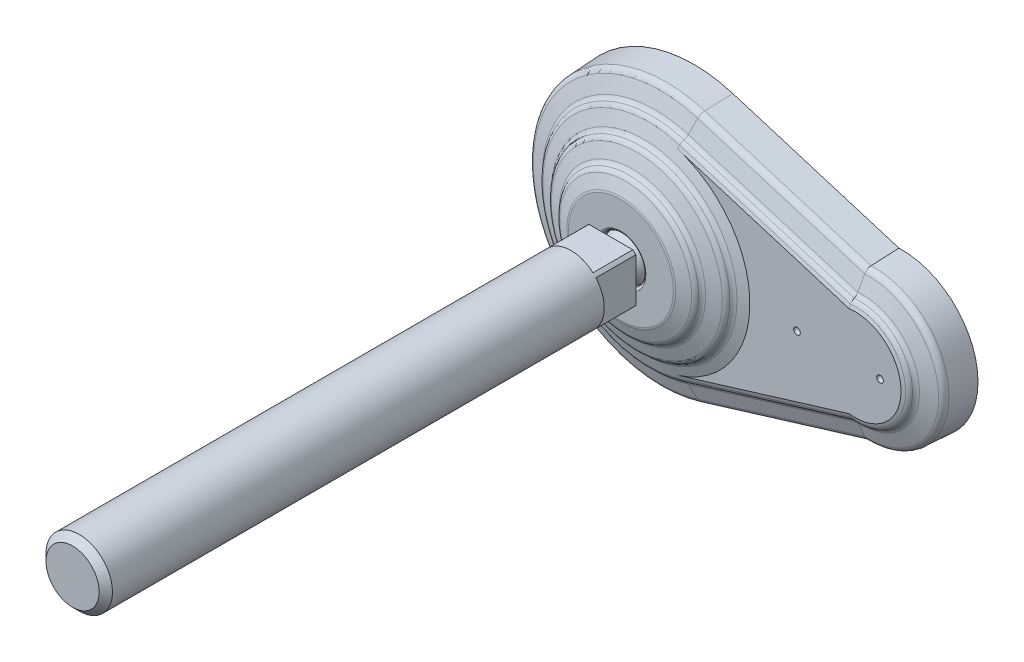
ISO-10303-21;
HEADER;
FILE_DESCRIPTION(('STEP AP214'),'2;1');
FILE_NAME('part.step','',(''),(''),'','','');
FILE_SCHEMA(('AUTOMOTIVE_DESIGN { 1 0 10303 214 1 1 1 1 }'));
ENDSEC;
DATA;
#1=APPLICATION_CONTEXT('core data for automotive mechanical design processes');
#2=APPLICATION_PROTOCOL_DEFINITION('international standard','automotive_design',2000,#1);
#3=PRODUCT_CONTEXT('',#1,'mechanical');
#4=PRODUCT('Part','Part','',(#3));
#5=PRODUCT_RELATED_PRODUCT_CATEGORY('part','',(#4));
#6=PRODUCT_DEFINITION_FORMATION('','',#4);
#7=PRODUCT_DEFINITION_CONTEXT('part definition',#1,'design');
#8=PRODUCT_DEFINITION('design','',#6,#7);
#9=PRODUCT_DEFINITION_SHAPE('','',#8);
#10=(LENGTH_UNIT() NAMED_UNIT(*) SI_UNIT(.MILLI.,.METRE.));
#11=(NAMED_UNIT(*) PLANE_ANGLE_UNIT() SI_UNIT($,.RADIAN.));
#12=(NAMED_UNIT(*) SI_UNIT($,.STERADIAN.) SOLID_ANGLE_UNIT());
#13=UNCERTAINTY_MEASURE_WITH_UNIT(LENGTH_MEASURE(1.E-05),#10,'distance_accuracy_value','');
#14=(GEOMETRIC_REPRESENTATION_CONTEXT(3) GLOBAL_UNCERTAINTY_ASSIGNED_CONTEXT((#13)) GLOBAL_UNIT_ASSIGNED_CONTEXT((#10,
#11,#12)) REPRESENTATION_CONTEXT('',''));
#15=CARTESIAN_POINT('',(0.,0.,0.));
#16=DIRECTION('',(0.,0.,1.));
#17=DIRECTION('',(1.,0.,0.));
#18=AXIS2_PLACEMENT_3D('',#15,#16,#17);
#19=CARTESIAN_POINT('',(0.,0.,39.));
#20=DIRECTION('',(0.,0.,1.));
#21=DIRECTION('',(-1.,0.,0.));
#22=AXIS2_PLACEMENT_3D('',#19,#20,#21);
#23=CYLINDRICAL_SURFACE('',#22,10.);
#24=CARTESIAN_POINT('',(0.,0.,187.));
#25=DIRECTION('',(0.,0.,1.));
#26=DIRECTION('',(-1.,0.,0.));
#27=AXIS2_PLACEMENT_3D('',#24,#25,#26);
#28=CIRCLE('',#27,10.);
#29=CARTESIAN_POINT('',(-10.,0.,187.));
#30=VERTEX_POINT('',#29);
#31=EDGE_CURVE('E9',#30,#30,#28,.F.);
#32=ORIENTED_EDGE('',*,*,#31,.T.);
#33=EDGE_LOOP('',(#32));
#34=FACE_BOUND('',#33,.T.);
#35=DIRECTION('',(0.,0.,1.));
#36=VECTOR('',#35,1.);
#37=CARTESIAN_POINT('',(-6.61437827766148,-7.5,39.));
#38=LINE('',#37,#36);
#39=CARTESIAN_POINT('',(-6.61437827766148,-7.5,39.));
#40=VERTEX_POINT('',#39);
#41=CARTESIAN_POINT('',(-6.61437827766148,-7.5,27.));
#42=VERTEX_POINT('',#41);
#43=EDGE_CURVE('E159',#40,#42,#38,.F.);
#44=ORIENTED_EDGE('',*,*,#43,.F.);
#45=CARTESIAN_POINT('',(0.,0.,39.));
#46=DIRECTION('',(0.,0.,1.));
#47=DIRECTION('',(0.,-1.,0.));
#48=AXIS2_PLACEMENT_3D('',#45,#46,#47);
#49=CIRCLE('',#48,10.);
#50=CARTESIAN_POINT('',(6.61437827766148,-7.5,39.));
#51=VERTEX_POINT('',#50);
#52=EDGE_CURVE('E805',#40,#51,#49,.T.);
#53=ORIENTED_EDGE('',*,*,#52,.T.);
#54=DIRECTION('',(0.,0.,1.));
#55=VECTOR('',#54,1.);
#56=CARTESIAN_POINT('',(6.61437827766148,-7.5,39.));
#57=LINE('',#56,#55);
#58=CARTESIAN_POINT('',(6.61437827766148,-7.5,27.));
#59=VERTEX_POINT('',#58);
#60=EDGE_CURVE('E224',#59,#51,#57,.T.);
#61=ORIENTED_EDGE('',*,*,#60,.F.);
#62=CARTESIAN_POINT('',(0.,0.,27.));
#63=DIRECTION('',(0.,0.,1.));
#64=DIRECTION('',(-1.,0.,0.));
#65=AXIS2_PLACEMENT_3D('',#62,#63,#64);
#66=CIRCLE('',#65,10.);
#67=CARTESIAN_POINT('',(7.5,-6.61437827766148,27.));
#68=VERTEX_POINT('',#67);
#69=EDGE_CURVE('E207',#59,#68,#66,.T.);
#70=ORIENTED_EDGE('',*,*,#69,.T.);
#71=DIRECTION('',(0.,0.,1.));
#72=VECTOR('',#71,1.);
#73=CARTESIAN_POINT('',(7.5,-6.61437827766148,39.));
#74=LINE('',#73,#72);
#75=CARTESIAN_POINT('',(7.5,-6.61437827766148,39.));
#76=VERTEX_POINT('',#75);
#77=EDGE_CURVE('E221',#76,#68,#74,.F.);
#78=ORIENTED_EDGE('',*,*,#77,.F.);
#79=CARTESIAN_POINT('',(7.5,6.61437827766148,39.));
#80=VERTEX_POINT('',#79);
#81=EDGE_CURVE('E301',#76,#80,#49,.T.);
#82=ORIENTED_EDGE('',*,*,#81,.T.);
#83=DIRECTION('',(0.,0.,1.));
#84=VECTOR('',#83,1.);
#85=CARTESIAN_POINT('',(7.5,6.61437827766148,39.));
#86=LINE('',#85,#84);
#87=CARTESIAN_POINT('',(7.5,6.61437827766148,27.));
#88=VERTEX_POINT('',#87);
#89=EDGE_CURVE('E266',#88,#80,#86,.T.);
#90=ORIENTED_EDGE('',*,*,#89,.F.);
#91=CARTESIAN_POINT('',(6.61437827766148,7.5,27.));
#92=VERTEX_POINT('',#91);
#93=EDGE_CURVE('E203',#88,#92,#66,.T.);
#94=ORIENTED_EDGE('',*,*,#93,.T.);
#95=DIRECTION('',(0.,0.,1.));
#96=VECTOR('',#95,1.);
#97=CARTESIAN_POINT('',(6.61437827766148,7.5,39.));
#98=LINE('',#97,#96);
#99=CARTESIAN_POINT('',(6.61437827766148,7.5,39.));
#100=VERTEX_POINT('',#99);
#101=EDGE_CURVE('E184',#100,#92,#98,.F.);
#102=ORIENTED_EDGE('',*,*,#101,.F.);
#103=CARTESIAN_POINT('',(-6.61437827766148,7.5,39.));
#104=VERTEX_POINT('',#103);
#105=EDGE_CURVE('E197',#100,#104,#49,.T.);
#106=ORIENTED_EDGE('',*,*,#105,.T.);
#107=DIRECTION('',(0.,0.,1.));
#108=VECTOR('',#107,1.);
#109=CARTESIAN_POINT('',(-6.61437827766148,7.5,39.));
#110=LINE('',#109,#108);
#111=CARTESIAN_POINT('',(-6.61437827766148,7.5,27.));
#112=VERTEX_POINT('',#111);
#113=EDGE_CURVE('E182',#112,#104,#110,.T.);
#114=ORIENTED_EDGE('',*,*,#113,.F.);
#115=CARTESIAN_POINT('',(-7.5,6.61437827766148,27.));
#116=VERTEX_POINT('',#115);
#117=EDGE_CURVE('E195',#112,#116,#66,.T.);
#118=ORIENTED_EDGE('',*,*,#117,.T.);
#119=DIRECTION('',(0.,0.,1.));
#120=VECTOR('',#119,1.);
#121=CARTESIAN_POINT('',(-7.5,6.61437827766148,39.));
#122=LINE('',#121,#120);
#123=CARTESIAN_POINT('',(-7.5,6.61437827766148,39.));
#124=VERTEX_POINT('',#123);
#125=EDGE_CURVE('E198',#124,#116,#122,.F.);
#126=ORIENTED_EDGE('',*,*,#125,.F.);
#127=CARTESIAN_POINT('',(-7.5,-6.61437827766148,39.));
#128=VERTEX_POINT('',#127);
#129=EDGE_CURVE('E806',#124,#128,#49,.T.);
#130=ORIENTED_EDGE('',*,*,#129,.T.);
#131=DIRECTION('',(0.,0.,1.));
#132=VECTOR('',#131,1.);
#133=CARTESIAN_POINT('',(-7.5,-6.61437827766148,39.));
#134=LINE('',#133,#132);
#135=CARTESIAN_POINT('',(-7.5,-6.61437827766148,27.));
#136=VERTEX_POINT('',#135);
#137=EDGE_CURVE('E204',#136,#128,#134,.T.);
#138=ORIENTED_EDGE('',*,*,#137,.F.);
#139=EDGE_CURVE('E206',#136,#42,#66,.T.);
#140=ORIENTED_EDGE('',*,*,#139,.T.);
#141=EDGE_LOOP('',(#44,#53,#61,#70,#78,#82,#90,#94,#102,#106,#114,#118,#126,#130,#138,#140));
#142=FACE_BOUND('',#141,.T.);
#143=ADVANCED_FACE('F15',(#34,#142),#23,.T.);
#144=CARTESIAN_POINT('',(-5.26544933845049,0.,27.));
#145=DIRECTION('',(0.,0.,1.));
#146=DIRECTION('',(-1.,0.,0.));
#147=AXIS2_PLACEMENT_3D('',#144,#145,#146);
#148=PLANE('',#147);
#149=DIRECTION('',(0.,-1.,0.));
#150=VECTOR('',#149,1.);
#151=CARTESIAN_POINT('',(-7.5,7.5,27.));
#152=LINE('',#151,#150);
#153=EDGE_CURVE('E32',#116,#136,#152,.T.);
#154=ORIENTED_EDGE('',*,*,#153,.F.);
#155=ORIENTED_EDGE('',*,*,#117,.F.);
#156=DIRECTION('',(-1.,0.,0.));
#157=VECTOR('',#156,1.);
#158=CARTESIAN_POINT('',(7.5,7.5,27.));
#159=LINE('',#158,#157);
#160=EDGE_CURVE('E177',#92,#112,#159,.T.);
#161=ORIENTED_EDGE('',*,*,#160,.F.);
#162=ORIENTED_EDGE('',*,*,#93,.F.);
#163=DIRECTION('',(0.,1.,0.));
#164=VECTOR('',#163,1.);
#165=CARTESIAN_POINT('',(7.5,-7.5,27.));
#166=LINE('',#165,#164);
#167=EDGE_CURVE('E189',#68,#88,#166,.T.);
#168=ORIENTED_EDGE('',*,*,#167,.F.);
#169=ORIENTED_EDGE('',*,*,#69,.F.);
#170=DIRECTION('',(1.,0.,0.));
#171=VECTOR('',#170,1.);
#172=CARTESIAN_POINT('',(-7.5,-7.5,27.));
#173=LINE('',#172,#171);
#174=EDGE_CURVE('E226',#42,#59,#173,.T.);
#175=ORIENTED_EDGE('',*,*,#174,.F.);
#176=ORIENTED_EDGE('',*,*,#139,.F.);
#177=EDGE_LOOP('',(#154,#155,#161,#162,#168,#169,#175,#176));
#178=FACE_BOUND('',#177,.T.);
#179=CARTESIAN_POINT('',(0.,0.,27.));
#180=DIRECTION('',(0.,0.,1.));
#181=DIRECTION('',(-1.,0.,0.));
#182=AXIS2_PLACEMENT_3D('',#179,#180,#181);
#183=CIRCLE('',#182,5.26544933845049);
#184=CARTESIAN_POINT('',(-5.26544933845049,0.,27.));
#185=VERTEX_POINT('',#184);
#186=EDGE_CURVE('E212',#185,#185,#183,.T.);
#187=ORIENTED_EDGE('',*,*,#186,.T.);
#188=EDGE_LOOP('',(#187));
#189=FACE_BOUND('',#188,.T.);
#190=ADVANCED_FACE('F200',(#178,#189),#148,.F.);
#191=CARTESIAN_POINT('',(0.,0.,20.6509999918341));
#192=DIRECTION('',(0.,0.,1.));
#193=DIRECTION('',(-1.,0.,0.));
#194=AXIS2_PLACEMENT_3D('',#191,#192,#193);
#195=DEGENERATE_TOROIDAL_SURFACE('',#194,0.000333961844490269,6.829,.T.);
#196=CARTESIAN_POINT('',(0.,0.,21.794));
#197=DIRECTION('',(0.,0.,-1.));
#198=DIRECTION('',(1.,0.,0.));
#199=AXIS2_PLACEMENT_3D('',#196,#197,#198);
#200=CIRCLE('',#199,6.733);
#201=CARTESIAN_POINT('',(6.733,0.,21.794));
#202=VERTEX_POINT('',#201);
#203=EDGE_CURVE('E273',#202,#202,#200,.T.);
#204=ORIENTED_EDGE('',*,*,#203,.F.);
#205=EDGE_LOOP('',(#204));
#206=FACE_BOUND('',#205,.T.);
#207=CARTESIAN_POINT('',(0.,0.,25.));
#208=DIRECTION('',(0.,0.,1.));
#209=DIRECTION('',(-1.,0.,0.));
#210=AXIS2_PLACEMENT_3D('',#207,#208,#209);
#211=CIRCLE('',#210,5.26544933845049);
#212=CARTESIAN_POINT('',(-5.26544933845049,0.,25.));
#213=VERTEX_POINT('',#212);
#214=EDGE_CURVE('E214',#213,#213,#211,.T.);
#215=ORIENTED_EDGE('',*,*,#214,.F.);
#216=EDGE_LOOP('',(#215));
#217=FACE_BOUND('',#216,.T.);
#218=ADVANCED_FACE('F512',(#206,#217),#195,.T.);
#219=CARTESIAN_POINT('',(0.,0.,39.));
#220=DIRECTION('',(0.,0.,1.));
#221=DIRECTION('',(-1.,0.,0.));
#222=AXIS2_PLACEMENT_3D('',#219,#220,#221);
#223=CYLINDRICAL_SURFACE('',#222,5.26544933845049);
#224=ORIENTED_EDGE('',*,*,#186,.F.);
#225=EDGE_LOOP('',(#224));
#226=FACE_BOUND('',#225,.T.);
#227=ORIENTED_EDGE('',*,*,#214,.T.);
#228=EDGE_LOOP('',(#227));
#229=FACE_BOUND('',#228,.T.);
#230=ADVANCED_FACE('F780',(#226,#229),#223,.T.);
#231=CARTESIAN_POINT('',(-7.5,-7.5,27.));
#232=DIRECTION('',(0.,-1.,0.));
#233=DIRECTION('',(1.,0.,0.));
#234=AXIS2_PLACEMENT_3D('',#231,#232,#233);
#235=PLANE('',#234);
#236=ORIENTED_EDGE('',*,*,#60,.T.);
#237=DIRECTION('',(-1.,0.,0.));
#238=VECTOR('',#237,1.);
#239=CARTESIAN_POINT('',(-10.,-7.5,39.));
#240=LINE('',#239,#238);
#241=EDGE_CURVE('E238',#51,#40,#240,.T.);
#242=ORIENTED_EDGE('',*,*,#241,.T.);
#243=ORIENTED_EDGE('',*,*,#43,.T.);
#244=ORIENTED_EDGE('',*,*,#174,.T.);
#245=EDGE_LOOP('',(#236,#242,#243,#244));
#246=FACE_BOUND('',#245,.T.);
#247=ADVANCED_FACE('F778',(#246),#235,.T.);
#248=CARTESIAN_POINT('',(7.5,-7.5,27.));
#249=DIRECTION('',(1.,0.,0.));
#250=DIRECTION('',(0.,1.,0.));
#251=AXIS2_PLACEMENT_3D('',#248,#249,#250);
#252=PLANE('',#251);
#253=ORIENTED_EDGE('',*,*,#89,.T.);
#254=DIRECTION('',(0.,-1.,0.));
#255=VECTOR('',#254,1.);
#256=CARTESIAN_POINT('',(7.5,0.,39.));
#257=LINE('',#256,#255);
#258=EDGE_CURVE('E245',#80,#76,#257,.T.);
#259=ORIENTED_EDGE('',*,*,#258,.T.);
#260=ORIENTED_EDGE('',*,*,#77,.T.);
#261=ORIENTED_EDGE('',*,*,#167,.T.);
#262=EDGE_LOOP('',(#253,#259,#260,#261));
#263=FACE_BOUND('',#262,.T.);
#264=ADVANCED_FACE('F774',(#263),#252,.T.);
#265=CARTESIAN_POINT('',(7.5,7.5,27.));
#266=DIRECTION('',(0.,1.,0.));
#267=DIRECTION('',(-1.,0.,0.));
#268=AXIS2_PLACEMENT_3D('',#265,#266,#267);
#269=PLANE('',#268);
#270=ORIENTED_EDGE('',*,*,#113,.T.);
#271=DIRECTION('',(1.,0.,0.));
#272=VECTOR('',#271,1.);
#273=CARTESIAN_POINT('',(-10.,7.5,39.));
#274=LINE('',#273,#272);
#275=EDGE_CURVE('E249',#104,#100,#274,.T.);
#276=ORIENTED_EDGE('',*,*,#275,.T.);
#277=ORIENTED_EDGE('',*,*,#101,.T.);
#278=ORIENTED_EDGE('',*,*,#160,.T.);
#279=EDGE_LOOP('',(#270,#276,#277,#278));
#280=FACE_BOUND('',#279,.T.);
#281=ADVANCED_FACE('F179',(#280),#269,.T.);
#282=CARTESIAN_POINT('',(-7.5,7.5,27.));
#283=DIRECTION('',(-1.,0.,0.));
#284=DIRECTION('',(0.,-1.,0.));
#285=AXIS2_PLACEMENT_3D('',#282,#283,#284);
#286=PLANE('',#285);
#287=ORIENTED_EDGE('',*,*,#137,.T.);
#288=DIRECTION('',(0.,1.,0.));
#289=VECTOR('',#288,1.);
#290=CARTESIAN_POINT('',(-7.5,0.,39.));
#291=LINE('',#290,#289);
#292=EDGE_CURVE('E262',#128,#124,#291,.T.);
#293=ORIENTED_EDGE('',*,*,#292,.T.);
#294=ORIENTED_EDGE('',*,*,#125,.T.);
#295=ORIENTED_EDGE('',*,*,#153,.T.);
#296=EDGE_LOOP('',(#287,#293,#294,#295));
#297=FACE_BOUND('',#296,.T.);
#298=ADVANCED_FACE('F754',(#297),#286,.T.);
#299=CARTESIAN_POINT('',(0.,0.,0.));
#300=DIRECTION('',(0.,0.,1.));
#301=DIRECTION('',(0.,-1.,0.));
#302=AXIS2_PLACEMENT_3D('',#299,#300,#301);
#303=PLANE('',#302);
#304=DIRECTION('',(-0.951485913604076,0.307692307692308,0.));
#305=VECTOR('',#304,1.);
#306=CARTESIAN_POINT('',(69.9230769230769,15.2237746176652,0.));
#307=LINE('',#306,#305);
#308=CARTESIAN_POINT('',(69.9230769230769,15.2237746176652,0.));
#309=VERTEX_POINT('',#308);
#310=CARTESIAN_POINT('',(11.0769230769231,34.2534928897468,0.));
#311=VERTEX_POINT('',#310);
#312=EDGE_CURVE('E285',#309,#311,#307,.T.);
#313=ORIENTED_EDGE('',*,*,#312,.F.);
#314=CARTESIAN_POINT('',(65.,0.,0.));
#315=DIRECTION('',(0.,0.,1.));
#316=DIRECTION('',(1.,0.,0.));
#317=AXIS2_PLACEMENT_3D('',#314,#315,#316);
#318=CIRCLE('',#317,16.);
#319=CARTESIAN_POINT('',(69.9230769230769,-15.2237746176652,0.));
#320=VERTEX_POINT('',#319);
#321=EDGE_CURVE('E295',#320,#309,#318,.T.);
#322=ORIENTED_EDGE('',*,*,#321,.F.);
#323=DIRECTION('',(0.951485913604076,0.307692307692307,0.));
#324=VECTOR('',#323,1.);
#325=CARTESIAN_POINT('',(11.0769230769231,-34.2534928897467,0.));
#326=LINE('',#325,#324);
#327=CARTESIAN_POINT('',(11.0769230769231,-34.2534928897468,0.));
#328=VERTEX_POINT('',#327);
#329=EDGE_CURVE('E292',#328,#320,#326,.T.);
#330=ORIENTED_EDGE('',*,*,#329,.F.);
#331=CARTESIAN_POINT('',(0.,0.,0.));
#332=DIRECTION('',(0.,0.,1.));
#333=DIRECTION('',(1.,0.,0.));
#334=AXIS2_PLACEMENT_3D('',#331,#332,#333);
#335=CIRCLE('',#334,36.);
#336=EDGE_CURVE('E288',#311,#328,#335,.T.);
#337=ORIENTED_EDGE('',*,*,#336,.F.);
#338=EDGE_LOOP('',(#313,#322,#330,#337));
#339=FACE_BOUND('',#338,.T.);
#340=ADVANCED_FACE('F514',(#339),#303,.F.);
#341=CARTESIAN_POINT('',(11.0769230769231,-34.2534928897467,0.));
#342=DIRECTION('',(0.307692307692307,-0.951485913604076,0.));
#343=DIRECTION('',(0.951485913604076,0.307692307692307,0.));
#344=AXIS2_PLACEMENT_3D('',#341,#342,#343);
#345=PLANE('',#344);
#346=DIRECTION('',(0.951485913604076,0.307692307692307,0.));
#347=VECTOR('',#346,1.);
#348=CARTESIAN_POINT('',(11.0769230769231,-34.2534928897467,2.));
#349=LINE('',#348,#347);
#350=CARTESIAN_POINT('',(11.0769230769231,-34.2534928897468,2.));
#351=VERTEX_POINT('',#350);
#352=CARTESIAN_POINT('',(69.9230769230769,-15.2237746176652,2.));
#353=VERTEX_POINT('',#352);
#354=EDGE_CURVE('E304',#351,#353,#349,.T.);
#355=ORIENTED_EDGE('',*,*,#354,.F.);
#356=DIRECTION('',(0.,0.,1.));
#357=VECTOR('',#356,1.);
#358=CARTESIAN_POINT('',(11.0769230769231,-34.2534928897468,0.));
#359=LINE('',#358,#357);
#360=EDGE_CURVE('E312',#328,#351,#359,.T.);
#361=ORIENTED_EDGE('',*,*,#360,.F.);
#362=ORIENTED_EDGE('',*,*,#329,.T.);
#363=DIRECTION('',(0.,0.,1.));
#364=VECTOR('',#363,1.);
#365=CARTESIAN_POINT('',(69.9230769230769,-15.2237746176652,0.));
#366=LINE('',#365,#364);
#367=EDGE_CURVE('E310',#320,#353,#366,.T.);
#368=ORIENTED_EDGE('',*,*,#367,.T.);
#369=EDGE_LOOP('',(#355,#361,#362,#368));
#370=FACE_BOUND('',#369,.T.);
#371=ADVANCED_FACE('F771',(#370),#345,.T.);
#372=CARTESIAN_POINT('',(0.,0.,0.));
#373=DIRECTION('',(0.,0.,1.));
#374=DIRECTION('',(0.,-1.,0.));
#375=AXIS2_PLACEMENT_3D('',#372,#373,#374);
#376=CYLINDRICAL_SURFACE('',#375,36.);
#377=CARTESIAN_POINT('',(0.,0.,2.));
#378=DIRECTION('',(0.,0.,1.));
#379=DIRECTION('',(1.,0.,0.));
#380=AXIS2_PLACEMENT_3D('',#377,#378,#379);
#381=CIRCLE('',#380,36.);
#382=CARTESIAN_POINT('',(11.0769230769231,34.2534928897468,2.));
#383=VERTEX_POINT('',#382);
#384=EDGE_CURVE('E300',#383,#351,#381,.T.);
#385=ORIENTED_EDGE('',*,*,#384,.F.);
#386=DIRECTION('',(0.,0.,1.));
#387=VECTOR('',#386,1.);
#388=CARTESIAN_POINT('',(11.0769230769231,34.2534928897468,0.));
#389=LINE('',#388,#387);
#390=EDGE_CURVE('E314',#311,#383,#389,.T.);
#391=ORIENTED_EDGE('',*,*,#390,.F.);
#392=ORIENTED_EDGE('',*,*,#336,.T.);
#393=ORIENTED_EDGE('',*,*,#360,.T.);
#394=EDGE_LOOP('',(#385,#391,#392,#393));
#395=FACE_BOUND('',#394,.T.);
#396=ADVANCED_FACE('F1138',(#395),#376,.T.);
#397=CARTESIAN_POINT('',(69.9230769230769,15.2237746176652,0.));
#398=DIRECTION('',(0.307692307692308,0.951485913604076,0.));
#399=DIRECTION('',(-0.951485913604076,0.307692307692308,0.));
#400=AXIS2_PLACEMENT_3D('',#397,#398,#399);
#401=PLANE('',#400);
#402=DIRECTION('',(-0.951485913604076,0.307692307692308,0.));
#403=VECTOR('',#402,1.);
#404=CARTESIAN_POINT('',(69.9230769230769,15.2237746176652,2.));
#405=LINE('',#404,#403);
#406=CARTESIAN_POINT('',(69.9230769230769,15.2237746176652,2.));
#407=VERTEX_POINT('',#406);
#408=EDGE_CURVE('E150',#407,#383,#405,.T.);
#409=ORIENTED_EDGE('',*,*,#408,.F.);
#410=DIRECTION('',(0.,0.,1.));
#411=VECTOR('',#410,1.);
#412=CARTESIAN_POINT('',(69.9230769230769,15.2237746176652,0.));
#413=LINE('',#412,#411);
#414=EDGE_CURVE('E298',#309,#407,#413,.T.);
#415=ORIENTED_EDGE('',*,*,#414,.F.);
#416=ORIENTED_EDGE('',*,*,#312,.T.);
#417=ORIENTED_EDGE('',*,*,#390,.T.);
#418=EDGE_LOOP('',(#409,#415,#416,#417));
#419=FACE_BOUND('',#418,.T.);
#420=ADVANCED_FACE('F538',(#419),#401,.T.);
#421=CARTESIAN_POINT('',(65.,0.,0.));
#422=DIRECTION('',(0.,0.,1.));
#423=DIRECTION('',(0.,-1.,0.));
#424=AXIS2_PLACEMENT_3D('',#421,#422,#423);
#425=CYLINDRICAL_SURFACE('',#424,16.);
#426=CARTESIAN_POINT('',(65.,0.,2.));
#427=DIRECTION('',(0.,0.,1.));
#428=DIRECTION('',(1.,0.,0.));
#429=AXIS2_PLACEMENT_3D('',#426,#427,#428);
#430=CIRCLE('',#429,16.);
#431=EDGE_CURVE('E289',#353,#407,#430,.T.);
#432=ORIENTED_EDGE('',*,*,#431,.F.);
#433=ORIENTED_EDGE('',*,*,#367,.F.);
#434=ORIENTED_EDGE('',*,*,#321,.T.);
#435=ORIENTED_EDGE('',*,*,#414,.T.);
#436=EDGE_LOOP('',(#432,#433,#434,#435));
#437=FACE_BOUND('',#436,.T.);
#438=ADVANCED_FACE('F523',(#437),#425,.T.);
#439=CARTESIAN_POINT('',(62.5,0.,2.));
#440=DIRECTION('',(0.,0.,-1.));
#441=DIRECTION('',(0.,1.,0.));
#442=AXIS2_PLACEMENT_3D('',#439,#440,#441);
#443=CONICAL_SURFACE('',#442,22.9787234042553,0.0523365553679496);
#444=CARTESIAN_POINT('',(62.5,0.,10.3041173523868));
#445=DIRECTION('',(0.,0.,1.));
#446=DIRECTION('',(0.,-1.,0.));
#447=AXIS2_PLACEMENT_3D('',#444,#445,#446);
#448=CIRCLE('',#447,22.5437172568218);
#449=CARTESIAN_POINT('',(61.6407011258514,-22.5273343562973,10.3041173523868));
#450=VERTEX_POINT('',#449);
#451=CARTESIAN_POINT('',(61.6407011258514,22.5273343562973,10.3041173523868));
#452=VERTEX_POINT('',#451);
#453=EDGE_CURVE('E344',#450,#452,#448,.T.);
#454=ORIENTED_EDGE('',*,*,#453,.F.);
#455=CARTESIAN_POINT('',(61.6406997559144,-22.5273238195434,10.3043173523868));
#456=CARTESIAN_POINT('',(61.6501805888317,-22.600242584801,8.92023165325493));
#457=CARTESIAN_POINT('',(61.6596900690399,-22.6731526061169,7.53614569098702));
#458=CARTESIAN_POINT('',(61.6787663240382,-22.8189551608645,4.76797324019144));
#459=CARTESIAN_POINT('',(61.6883330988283,-22.8918476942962,3.38388675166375));
#460=CARTESIAN_POINT('',(61.6979285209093,-22.9647314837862,1.9998));
#461=B_SPLINE_CURVE_WITH_KNOTS('',3,(#455,#456,#457,#458,#459,#460),.UNSPECIFIED.,.F.,.F.,(4,2,
4),(0.,4.15811282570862,8.31622565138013),.UNSPECIFIED.);
#462=CARTESIAN_POINT('',(61.697927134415,-22.9647209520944,2.));
#463=VERTEX_POINT('',#462);
#464=EDGE_CURVE('E651',#450,#463,#461,.T.);
#465=ORIENTED_EDGE('',*,*,#464,.T.);
#466=CARTESIAN_POINT('',(62.5,0.,2.));
#467=DIRECTION('',(0.,0.,1.));
#468=DIRECTION('',(0.,-1.,0.));
#469=AXIS2_PLACEMENT_3D('',#466,#467,#468);
#470=CIRCLE('',#469,22.9787234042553);
#471=CARTESIAN_POINT('',(61.6979271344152,22.9647209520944,2.));
#472=VERTEX_POINT('',#471);
#473=EDGE_CURVE('E346',#463,#472,#470,.T.);
#474=ORIENTED_EDGE('',*,*,#473,.T.);
#475=CARTESIAN_POINT('',(61.6979285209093,22.9647314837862,1.9998));
#476=CARTESIAN_POINT('',(61.6883330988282,22.8918476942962,3.38388675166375));
#477=CARTESIAN_POINT('',(61.6787663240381,22.8189551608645,4.76797324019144));
#478=CARTESIAN_POINT('',(61.6596900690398,22.6731526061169,7.53614569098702));
#479=CARTESIAN_POINT('',(61.6501805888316,22.600242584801,8.92023165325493));
#480=CARTESIAN_POINT('',(61.6406997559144,22.5273238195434,10.3043173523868));
#481=B_SPLINE_CURVE_WITH_KNOTS('',3,(#475,#476,#477,#478,#479,#480),.UNSPECIFIED.,.F.,.F.,(4,2,
4),(0.,4.15811282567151,8.31622565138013),.UNSPECIFIED.);
#482=EDGE_CURVE('E697',#472,#452,#481,.T.);
#483=ORIENTED_EDGE('',*,*,#482,.T.);
#484=EDGE_LOOP('',(#454,#465,#474,#483));
#485=FACE_BOUND('',#484,.T.);
#486=ADVANCED_FACE('F517',(#485),#443,.T.);
#487=CARTESIAN_POINT('',(64.1644462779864,-21.755748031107,10.3041173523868));
#488=DIRECTION('',(-0.291971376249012,0.9549953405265,-0.0523126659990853));
#489=DIRECTION('',(-0.956304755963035,-0.292371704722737,0.));
#490=AXIS2_PLACEMENT_3D('',#487,#488,#489);
#491=PLANE('',#490);
#492=ORIENTED_EDGE('',*,*,#464,.F.);
#493=DIRECTION('',(-0.956304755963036,-0.292371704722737,0.));
#494=VECTOR('',#493,1.);
#495=CARTESIAN_POINT('',(64.1644462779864,-21.755748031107,10.3041173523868));
#496=LINE('',#495,#494);
#497=CARTESIAN_POINT('',(11.5676847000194,-37.8361917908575,10.3041173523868));
#498=VERTEX_POINT('',#497);
#499=EDGE_CURVE('E600',#450,#498,#496,.T.);
#500=ORIENTED_EDGE('',*,*,#499,.T.);
#501=DIRECTION('',(-0.0152947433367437,0.050026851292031,0.998630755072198));
#502=VECTOR('',#501,1.);
#503=CARTESIAN_POINT('',(11.6948681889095,-38.2521902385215,2.));
#504=LINE('',#503,#502);
#505=CARTESIAN_POINT('',(11.6948681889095,-38.2521902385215,2.));
#506=VERTEX_POINT('',#505);
#507=EDGE_CURVE('E606',#506,#498,#504,.T.);
#508=ORIENTED_EDGE('',*,*,#507,.F.);
#509=DIRECTION('',(-0.956304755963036,-0.292371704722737,0.));
#510=VECTOR('',#509,1.);
#511=CARTESIAN_POINT('',(64.2916297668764,-22.1717464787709,2.));
#512=LINE('',#511,#510);
#513=EDGE_CURVE('E144',#463,#506,#512,.T.);
#514=ORIENTED_EDGE('',*,*,#513,.F.);
#515=EDGE_LOOP('',(#492,#500,#508,#514));
#516=FACE_BOUND('',#515,.T.);
#517=ADVANCED_FACE('F508',(#516),#491,.F.);
#518=CARTESIAN_POINT('',(0.,0.,2.));
#519=DIRECTION('',(0.,0.,1.));
#520=DIRECTION('',(-1.,0.,0.));
#521=AXIS2_PLACEMENT_3D('',#518,#519,#520);
#522=PLANE('',#521);
#523=DIRECTION('',(-0.956304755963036,0.292371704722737,0.));
#524=VECTOR('',#523,1.);
#525=CARTESIAN_POINT('',(64.2916297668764,22.1717464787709,2.));
#526=LINE('',#525,#524);
#527=CARTESIAN_POINT('',(11.6948681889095,38.2521902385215,2.));
#528=VERTEX_POINT('',#527);
#529=EDGE_CURVE('E653',#472,#528,#526,.T.);
#530=ORIENTED_EDGE('',*,*,#529,.F.);
#531=ORIENTED_EDGE('',*,*,#473,.F.);
#532=ORIENTED_EDGE('',*,*,#513,.T.);
#533=CARTESIAN_POINT('',(0.,0.,2.));
#534=DIRECTION('',(0.,0.,1.));
#535=DIRECTION('',(-1.,0.,0.));
#536=AXIS2_PLACEMENT_3D('',#533,#534,#535);
#537=CIRCLE('',#536,40.);
#538=EDGE_CURVE('E389',#528,#506,#537,.T.);
#539=ORIENTED_EDGE('',*,*,#538,.F.);
#540=EDGE_LOOP('',(#530,#531,#532,#539));
#541=FACE_BOUND('',#540,.T.);
#542=ORIENTED_EDGE('',*,*,#431,.T.);
#543=ORIENTED_EDGE('',*,*,#408,.T.);
#544=ORIENTED_EDGE('',*,*,#384,.T.);
#545=ORIENTED_EDGE('',*,*,#354,.T.);
#546=EDGE_LOOP('',(#542,#543,#544,#545));
#547=FACE_BOUND('',#546,.T.);
#548=ADVANCED_FACE('F398',(#541,#547),#522,.F.);
#549=CARTESIAN_POINT('',(64.2916297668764,22.1717464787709,2.));
#550=DIRECTION('',(-0.291971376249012,-0.9549953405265,-0.0523126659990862));
#551=DIRECTION('',(0.956304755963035,-0.292371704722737,0.));
#552=AXIS2_PLACEMENT_3D('',#549,#550,#551);
#553=PLANE('',#552);
#554=ORIENTED_EDGE('',*,*,#482,.F.);
#555=ORIENTED_EDGE('',*,*,#529,.T.);
#556=DIRECTION('',(-0.0152947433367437,-0.050026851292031,0.998630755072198));
#557=VECTOR('',#556,1.);
#558=CARTESIAN_POINT('',(11.6948681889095,38.2521902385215,2.));
#559=LINE('',#558,#557);
#560=CARTESIAN_POINT('',(11.5676847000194,37.8361917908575,10.3041173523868));
#561=VERTEX_POINT('',#560);
#562=EDGE_CURVE('E620',#528,#561,#559,.T.);
#563=ORIENTED_EDGE('',*,*,#562,.T.);
#564=DIRECTION('',(-0.956304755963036,0.292371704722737,0.));
#565=VECTOR('',#564,1.);
#566=CARTESIAN_POINT('',(64.1644462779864,21.755748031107,10.3041173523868));
#567=LINE('',#566,#565);
#568=EDGE_CURVE('E654',#452,#561,#567,.T.);
#569=ORIENTED_EDGE('',*,*,#568,.F.);
#570=EDGE_LOOP('',(#554,#555,#563,#569));
#571=FACE_BOUND('',#570,.T.);
#572=ADVANCED_FACE('F478',(#571),#553,.F.);
#573=CARTESIAN_POINT('',(62.5,0.,10.1991258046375));
#574=DIRECTION('',(0.,0.,1.));
#575=DIRECTION('',(0.,-1.,0.));
#576=AXIS2_PLACEMENT_3D('',#573,#574,#575);
#577=TOROIDAL_SURFACE('',#576,20.5394653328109,2.007);
#578=CARTESIAN_POINT('',(61.6407233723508,-22.5275054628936,10.0974340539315));
#579=CARTESIAN_POINT('',(61.6409510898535,-22.5292569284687,10.1317993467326));
#580=CARTESIAN_POINT('',(61.6410635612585,-22.5301219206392,10.1661964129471));
#581=CARTESIAN_POINT('',(61.6410572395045,-22.5300732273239,10.235045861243));
#582=CARTESIAN_POINT('',(61.6409380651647,-22.5291566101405,10.2694982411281));
#583=CARTESIAN_POINT('',(61.6399396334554,-22.5214778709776,10.4153785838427));
#584=CARTESIAN_POINT('',(61.6379561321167,-22.5062239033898,10.526490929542));
#585=CARTESIAN_POINT('',(61.6316126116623,-22.4573679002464,10.7446232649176));
#586=CARTESIAN_POINT('',(61.6272490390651,-22.4237384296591,10.8516368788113));
#587=CARTESIAN_POINT('',(61.6163034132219,-22.339189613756,11.058357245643));
#588=CARTESIAN_POINT('',(61.6097238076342,-22.2882893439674,11.1580719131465));
#589=CARTESIAN_POINT('',(61.5945702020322,-22.1707054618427,11.3475467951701));
#590=CARTESIAN_POINT('',(61.5859960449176,-22.1040206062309,11.4373062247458));
#591=CARTESIAN_POINT('',(61.5670698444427,-21.9562760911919,11.6050783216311));
#592=CARTESIAN_POINT('',(61.5567047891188,-21.8751110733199,11.6829965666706));
#593=CARTESIAN_POINT('',(61.5345911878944,-21.7011851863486,11.8241014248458));
#594=CARTESIAN_POINT('',(61.5228449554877,-21.6084436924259,11.8873121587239));
#595=CARTESIAN_POINT('',(61.5046129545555,-21.4637836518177,11.9692866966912));
#596=CARTESIAN_POINT('',(61.4985079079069,-21.4152343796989,11.9942523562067));
#597=CARTESIAN_POINT('',(61.4860940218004,-21.3162718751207,12.0401972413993));
#598=CARTESIAN_POINT('',(61.4797850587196,-21.2658575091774,12.0611739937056));
#599=CARTESIAN_POINT('',(61.4596293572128,-21.1043762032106,12.1208327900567));
#600=CARTESIAN_POINT('',(61.4454888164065,-20.9904779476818,12.1519983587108));
#601=CARTESIAN_POINT('',(61.4169436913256,-20.7591475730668,12.1941665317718));
#602=CARTESIAN_POINT('',(61.4025394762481,-20.6417202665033,12.2051954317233));
#603=CARTESIAN_POINT('',(61.3876252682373,-20.5193667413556,12.2061070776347));
#604=CARTESIAN_POINT('',(61.3870090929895,-20.5143103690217,12.2061258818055));
#605=CARTESIAN_POINT('',(61.3863931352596,-20.5092543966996,12.2061258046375));
#606=B_SPLINE_CURVE_WITH_KNOTS('',3,(#578,#579,#580,#581,#582,#583,#584,#585,#586,#587,#588,
#589,#590,#591,#592,#593,#594,#595,#596,#597,#598,#599,#600,#601,#602,#603,#604,#605),
.UNSPECIFIED.,.F.,.F.,(4,2,2,2,2,2,2,2,2,2,2,2,2,4),(0.,0.103191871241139,0.20655369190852,
0.541275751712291,0.87649892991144,1.21135305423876,1.54623356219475,1.8836582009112,
2.22052549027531,2.38517216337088,2.54992059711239,2.9048600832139,3.25933573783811,
3.2746170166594),.UNSPECIFIED.);
#607=CARTESIAN_POINT('',(61.4734629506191,-21.2152067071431,12.0798866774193));
#608=VERTEX_POINT('',#607);
#609=EDGE_CURVE('E1245',#450,#608,#606,.T.);
#610=ORIENTED_EDGE('',*,*,#609,.F.);
#611=ORIENTED_EDGE('',*,*,#453,.T.);
#612=CARTESIAN_POINT('',(61.3863931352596,20.5092543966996,12.2061258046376));
#613=CARTESIAN_POINT('',(61.3870091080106,20.5143104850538,12.2061258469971));
#614=CARTESIAN_POINT('',(61.3876252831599,20.5193668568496,12.206107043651));
#615=CARTESIAN_POINT('',(61.3988855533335,20.6117442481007,12.2054193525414));
#616=CARTESIAN_POINT('',(61.4095840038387,20.6991031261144,12.1991511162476));
#617=CARTESIAN_POINT('',(61.4308936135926,20.8723273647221,12.1754412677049));
#618=CARTESIAN_POINT('',(61.4415047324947,20.9581920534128,12.1579947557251));
#619=CARTESIAN_POINT('',(61.4555813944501,21.0716202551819,12.1272225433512));
#620=CARTESIAN_POINT('',(61.4591730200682,21.1005182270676,12.1186877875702));
#621=CARTESIAN_POINT('',(61.4663157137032,21.1579059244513,12.1003430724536));
#622=CARTESIAN_POINT('',(61.4698667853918,21.1863956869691,12.090533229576));
#623=CARTESIAN_POINT('',(61.4866782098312,21.3210820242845,12.0407628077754));
#624=CARTESIAN_POINT('',(61.4996430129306,21.4243838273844,11.9924168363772));
#625=CARTESIAN_POINT('',(61.5245148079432,21.6216549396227,11.8789198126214));
#626=CARTESIAN_POINT('',(61.5364193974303,21.7156031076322,11.8137318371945));
#627=CARTESIAN_POINT('',(61.5587594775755,21.8912250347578,11.6683429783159));
#628=CARTESIAN_POINT('',(61.5691956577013,21.9729045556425,11.5881491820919));
#629=CARTESIAN_POINT('',(61.5882470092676,22.1215501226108,11.4149543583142));
#630=CARTESIAN_POINT('',(61.5968625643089,22.1885192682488,11.3219560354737));
#631=CARTESIAN_POINT('',(61.6119005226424,22.3051440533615,11.1267480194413));
#632=CARTESIAN_POINT('',(61.6183432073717,22.3549598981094,11.0246354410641));
#633=CARTESIAN_POINT('',(61.6289130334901,22.4365717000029,10.8134345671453));
#634=CARTESIAN_POINT('',(61.6330436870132,22.4683949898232,10.704357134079));
#635=CARTESIAN_POINT('',(61.6371976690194,22.5003783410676,10.5457196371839));
#636=CARTESIAN_POINT('',(61.6382205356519,22.5082502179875,10.4976293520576));
#637=CARTESIAN_POINT('',(61.639806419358,22.5204527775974,10.4010313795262));
#638=CARTESIAN_POINT('',(61.6403698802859,22.52478687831,10.3525241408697));
#639=CARTESIAN_POINT('',(61.6411729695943,22.5309631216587,10.2351641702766));
#640=CARTESIAN_POINT('',(61.641181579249,22.5310278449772,10.1662118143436));
#641=CARTESIAN_POINT('',(61.6407233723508,22.5275054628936,10.0974340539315));
#642=B_SPLINE_CURVE_WITH_KNOTS('',3,(#612,#613,#614,#615,#616,#617,#618,#619,#620,#621,#622,
#623,#624,#625,#626,#627,#628,#629,#630,#631,#632,#633,#634,#635,#636,#637,#638,#639,#640,#641),
.UNSPECIFIED.,.F.,.F.,(4,2,2,2,2,2,2,2,2,2,2,2,2,2,4),(0.,0.0152812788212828,0.279174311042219,
0.543183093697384,0.634194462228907,0.725197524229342,1.06775959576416,1.41107914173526,
1.75423694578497,2.09732237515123,2.43711059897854,2.77638125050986,2.92250118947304,
3.06847978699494,3.27496314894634),.UNSPECIFIED.);
#643=CARTESIAN_POINT('',(61.4734629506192,21.2152067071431,12.0798866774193));
#644=VERTEX_POINT('',#643);
#645=EDGE_CURVE('E467',#644,#452,#642,.T.);
#646=ORIENTED_EDGE('',*,*,#645,.F.);
#647=CARTESIAN_POINT('',(62.5,0.,12.0798866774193));
#648=DIRECTION('',(0.,0.,1.));
#649=DIRECTION('',(0.,-1.,0.));
#650=AXIS2_PLACEMENT_3D('',#647,#648,#649);
#651=CIRCLE('',#650,21.2400276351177);
#652=EDGE_CURVE('E342',#608,#644,#651,.T.);
#653=ORIENTED_EDGE('',*,*,#652,.F.);
#654=EDGE_LOOP('',(#610,#611,#646,#653));
#655=FACE_BOUND('',#654,.T.);
#656=ADVANCED_FACE('F449',(#655),#577,.T.);
#657=CARTESIAN_POINT('',(63.5784597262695,-19.8390723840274,10.1991258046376));
#658=DIRECTION('',(-0.956304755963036,-0.292371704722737,0.));
#659=DIRECTION('',(0.292371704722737,-0.956304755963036,0.));
#660=AXIS2_PLACEMENT_3D('',#657,#658,#659);
#661=CYLINDRICAL_SURFACE('',#660,2.00699999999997);
#662=ORIENTED_EDGE('',*,*,#499,.F.);
#663=ORIENTED_EDGE('',*,*,#609,.T.);
#664=DIRECTION('',(-0.956304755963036,-0.292371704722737,0.));
#665=VECTOR('',#664,1.);
#666=CARTESIAN_POINT('',(63.7832843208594,-20.5090234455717,12.0798866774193));
#667=LINE('',#666,#665);
#668=CARTESIAN_POINT('',(11.1865227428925,-36.5894672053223,12.0798866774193));
#669=VERTEX_POINT('',#668);
#670=EDGE_CURVE('E597',#608,#669,#667,.T.);
#671=ORIENTED_EDGE('',*,*,#670,.T.);
#672=CARTESIAN_POINT('',(10.9816981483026,-35.9195161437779,10.1991258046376));
#673=DIRECTION('',(0.956304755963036,0.292371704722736,0.));
#674=DIRECTION('',(-0.292371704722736,0.956304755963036,0.));
#675=AXIS2_PLACEMENT_3D('',#672,#673,#674);
#676=CIRCLE('',#675,2.007);
#677=EDGE_CURVE('E609',#669,#498,#676,.T.);
#678=ORIENTED_EDGE('',*,*,#677,.T.);
#679=EDGE_LOOP('',(#662,#663,#671,#678));
#680=FACE_BOUND('',#679,.T.);
#681=ADVANCED_FACE('F479',(#680),#661,.T.);
#682=CARTESIAN_POINT('',(0.,0.,2.));
#683=DIRECTION('',(0.,0.,-1.));
#684=DIRECTION('',(1.,0.,0.));
#685=AXIS2_PLACEMENT_3D('',#682,#683,#684);
#686=CONICAL_SURFACE('',#685,40.,0.0523365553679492);
#687=CARTESIAN_POINT('',(0.,0.,10.3041173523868));
#688=DIRECTION('',(0.,0.,1.));
#689=DIRECTION('',(-1.,0.,0.));
#690=AXIS2_PLACEMENT_3D('',#687,#688,#689);
#691=CIRCLE('',#690,39.5649938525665);
#692=EDGE_CURVE('E640',#561,#498,#691,.T.);
#693=ORIENTED_EDGE('',*,*,#692,.F.);
#694=ORIENTED_EDGE('',*,*,#562,.F.);
#695=ORIENTED_EDGE('',*,*,#538,.T.);
#696=ORIENTED_EDGE('',*,*,#507,.T.);
#697=EDGE_LOOP('',(#693,#694,#695,#696));
#698=FACE_BOUND('',#697,.T.);
#699=ADVANCED_FACE('F499',(#698),#686,.T.);
#700=CARTESIAN_POINT('',(63.5784597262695,19.8390723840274,10.1991258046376));
#701=DIRECTION('',(-0.956304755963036,0.292371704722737,0.));
#702=DIRECTION('',(-0.292371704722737,-0.956304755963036,0.));
#703=AXIS2_PLACEMENT_3D('',#700,#701,#702);
#704=CYLINDRICAL_SURFACE('',#703,2.00699999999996);
#705=DIRECTION('',(-0.956304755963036,0.292371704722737,0.));
#706=VECTOR('',#705,1.);
#707=CARTESIAN_POINT('',(63.7832843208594,20.5090234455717,12.0798866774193));
#708=LINE('',#707,#706);
#709=CARTESIAN_POINT('',(11.1865227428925,36.5894672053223,12.0798866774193));
#710=VERTEX_POINT('',#709);
#711=EDGE_CURVE('E586',#644,#710,#708,.T.);
#712=ORIENTED_EDGE('',*,*,#711,.F.);
#713=ORIENTED_EDGE('',*,*,#645,.T.);
#714=ORIENTED_EDGE('',*,*,#568,.T.);
#715=CARTESIAN_POINT('',(10.9816981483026,35.9195161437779,10.1991258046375));
#716=DIRECTION('',(-0.956304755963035,0.292371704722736,0.));
#717=DIRECTION('',(-0.292371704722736,-0.956304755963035,0.));
#718=AXIS2_PLACEMENT_3D('',#715,#716,#717);
#719=CIRCLE('',#718,2.007);
#720=EDGE_CURVE('E623',#710,#561,#719,.T.);
#721=ORIENTED_EDGE('',*,*,#720,.F.);
#722=EDGE_LOOP('',(#712,#713,#714,#721));
#723=FACE_BOUND('',#722,.T.);
#724=ADVANCED_FACE('F407',(#723),#704,.T.);
#725=CARTESIAN_POINT('',(62.5,0.,12.0798866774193));
#726=DIRECTION('',(0.,0.,-1.));
#727=DIRECTION('',(0.,1.,0.));
#728=AXIS2_PLACEMENT_3D('',#725,#726,#727);
#729=CONICAL_SURFACE('',#728,21.2400276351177,1.21422909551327);
#730=CARTESIAN_POINT('',(62.5,0.,13.656251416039));
#731=DIRECTION('',(0.,0.,1.));
#732=DIRECTION('',(0.,-1.,0.));
#733=AXIS2_PLACEMENT_3D('',#730,#731,#732);
#734=CIRCLE('',#733,17.0080484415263);
#735=CARTESIAN_POINT('',(60.9818619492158,-16.9401584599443,13.656251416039));
#736=VERTEX_POINT('',#735);
#737=CARTESIAN_POINT('',(60.9818619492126,16.9401584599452,13.656251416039));
#738=VERTEX_POINT('',#737);
#739=EDGE_CURVE('E340',#736,#738,#734,.T.);
#740=ORIENTED_EDGE('',*,*,#739,.F.);
#741=CARTESIAN_POINT('',(60.9818053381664,-16.9396143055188,13.656451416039));
#742=CARTESIAN_POINT('',(61.0189355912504,-17.2964789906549,13.5252879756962));
#743=CARTESIAN_POINT('',(61.0571375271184,-17.653206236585,13.3940567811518));
#744=CARTESIAN_POINT('',(61.1355151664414,-18.3663907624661,13.1314756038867));
#745=CARTESIAN_POINT('',(61.1756908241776,-18.7228480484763,13.0001256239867));
#746=CARTESIAN_POINT('',(61.2578477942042,-19.435511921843,12.7373183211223));
#747=CARTESIAN_POINT('',(61.2998290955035,-19.7917185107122,12.6058609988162));
#748=CARTESIAN_POINT('',(61.3854616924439,-20.5039033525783,12.3428458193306));
#749=CARTESIAN_POINT('',(61.4291130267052,-20.8598816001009,12.2112879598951));
#750=CARTESIAN_POINT('',(61.4735304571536,-21.2157475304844,12.0796866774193));
#751=B_SPLINE_CURVE_WITH_KNOTS('',3,(#741,#742,#743,#744,#745,#746,#747,#748,#749,#750),
.UNSPECIFIED.,.F.,.F.,(4,2,2,2,4),(0.,1.14603990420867,2.29205327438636,3.43805966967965,
4.58409258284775),.UNSPECIFIED.);
#752=EDGE_CURVE('E459',#736,#608,#751,.T.);
#753=ORIENTED_EDGE('',*,*,#752,.T.);
#754=ORIENTED_EDGE('',*,*,#652,.T.);
#755=CARTESIAN_POINT('',(61.4735304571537,21.2157475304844,12.0796866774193));
#756=CARTESIAN_POINT('',(61.4291130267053,20.8598816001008,12.2112879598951));
#757=CARTESIAN_POINT('',(61.3854616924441,20.5039033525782,12.3428458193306));
#758=CARTESIAN_POINT('',(61.2998290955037,19.7917185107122,12.6058609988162));
#759=CARTESIAN_POINT('',(61.2578477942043,19.435511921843,12.7373183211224));
#760=CARTESIAN_POINT('',(61.1756908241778,18.7228480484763,13.0001256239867));
#761=CARTESIAN_POINT('',(61.1355151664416,18.3663907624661,13.1314756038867));
#762=CARTESIAN_POINT('',(61.0571375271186,17.653206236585,13.3940567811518));
#763=CARTESIAN_POINT('',(61.0189355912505,17.2964789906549,13.5252879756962));
#764=CARTESIAN_POINT('',(60.9818053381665,16.9396143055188,13.656451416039));
#765=B_SPLINE_CURVE_WITH_KNOTS('',3,(#755,#756,#757,#758,#759,#760,#761,#762,#763,#764),
.UNSPECIFIED.,.F.,.F.,(4,2,2,2,4),(0.,1.14603291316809,2.29203930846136,3.43805267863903,
4.58409258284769),.UNSPECIFIED.);
#766=EDGE_CURVE('E453',#644,#738,#765,.T.);
#767=ORIENTED_EDGE('',*,*,#766,.T.);
#768=EDGE_LOOP('',(#740,#753,#754,#767));
#769=FACE_BOUND('',#768,.T.);
#770=ADVANCED_FACE('F442',(#769),#729,.T.);
#771=CARTESIAN_POINT('',(62.545973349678,-16.4619616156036,13.656251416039));
#772=DIRECTION('',(-0.102055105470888,0.333807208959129,-0.937100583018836));
#773=DIRECTION('',(0.,0.942019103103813,0.335559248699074));
#774=AXIS2_PLACEMENT_3D('',#771,#772,#773);
#775=PLANE('',#774);
#776=ORIENTED_EDGE('',*,*,#752,.F.);
#777=DIRECTION('',(-0.956304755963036,-0.292371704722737,0.));
#778=VECTOR('',#777,1.);
#779=CARTESIAN_POINT('',(62.545973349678,-16.4619616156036,13.656251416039));
#780=LINE('',#779,#778);
#781=CARTESIAN_POINT('',(9.949211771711,-32.5424053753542,13.656251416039));
#782=VERTEX_POINT('',#781);
#783=EDGE_CURVE('E592',#736,#782,#780,.T.);
#784=ORIENTED_EDGE('',*,*,#783,.T.);
#785=DIRECTION('',(-0.273981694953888,0.896153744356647,0.349059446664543));
#786=VECTOR('',#785,1.);
#787=CARTESIAN_POINT('',(11.1865227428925,-36.5894672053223,12.0798866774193));
#788=LINE('',#787,#786);
#789=EDGE_CURVE('E612',#669,#782,#788,.T.);
#790=ORIENTED_EDGE('',*,*,#789,.F.);
#791=ORIENTED_EDGE('',*,*,#670,.F.);
#792=EDGE_LOOP('',(#776,#784,#790,#791));
#793=FACE_BOUND('',#792,.T.);
#794=ADVANCED_FACE('F447',(#793),#775,.F.);
#795=CARTESIAN_POINT('',(0.,0.,10.1991258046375));
#796=DIRECTION('',(0.,0.,1.));
#797=DIRECTION('',(-1.,0.,0.));
#798=AXIS2_PLACEMENT_3D('',#795,#796,#797);
#799=TOROIDAL_SURFACE('',#798,37.5607419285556,2.007);
#800=CARTESIAN_POINT('',(0.,0.,12.0798866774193));
#801=DIRECTION('',(0.,0.,1.));
#802=DIRECTION('',(-1.,0.,0.));
#803=AXIS2_PLACEMENT_3D('',#800,#801,#802);
#804=CIRCLE('',#803,38.2613042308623);
#805=EDGE_CURVE('E638',#710,#669,#804,.T.);
#806=ORIENTED_EDGE('',*,*,#805,.F.);
#807=ORIENTED_EDGE('',*,*,#720,.T.);
#808=ORIENTED_EDGE('',*,*,#692,.T.);
#809=ORIENTED_EDGE('',*,*,#677,.F.);
#810=EDGE_LOOP('',(#806,#807,#808,#809));
#811=FACE_BOUND('',#810,.T.);
#812=ADVANCED_FACE('F476',(#811),#799,.T.);
#813=CARTESIAN_POINT('',(63.7832843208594,20.5090234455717,12.0798866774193));
#814=DIRECTION('',(-0.102055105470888,-0.333807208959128,-0.937100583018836));
#815=DIRECTION('',(0.,0.942019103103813,-0.335559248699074));
#816=AXIS2_PLACEMENT_3D('',#813,#814,#815);
#817=PLANE('',#816);
#818=ORIENTED_EDGE('',*,*,#766,.F.);
#819=ORIENTED_EDGE('',*,*,#711,.T.);
#820=DIRECTION('',(-0.273981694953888,-0.896153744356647,0.349059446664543));
#821=VECTOR('',#820,1.);
#822=CARTESIAN_POINT('',(11.1865227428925,36.5894672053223,12.0798866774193));
#823=LINE('',#822,#821);
#824=CARTESIAN_POINT('',(9.949211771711,32.5424053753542,13.656251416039));
#825=VERTEX_POINT('',#824);
#826=EDGE_CURVE('E585',#710,#825,#823,.T.);
#827=ORIENTED_EDGE('',*,*,#826,.T.);
#828=DIRECTION('',(-0.956304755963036,0.292371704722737,0.));
#829=VECTOR('',#828,1.);
#830=CARTESIAN_POINT('',(62.545973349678,16.4619616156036,13.656251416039));
#831=LINE('',#830,#829);
#832=EDGE_CURVE('E577',#738,#825,#831,.T.);
#833=ORIENTED_EDGE('',*,*,#832,.F.);
#834=EDGE_LOOP('',(#818,#819,#827,#833));
#835=FACE_BOUND('',#834,.T.);
#836=ADVANCED_FACE('F413',(#835),#817,.F.);
#837=CARTESIAN_POINT('',(62.5,0.,15.5370123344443));
#838=DIRECTION('',(0.,0.,1.));
#839=DIRECTION('',(0.,-1.,0.));
#840=AXIS2_PLACEMENT_3D('',#837,#838,#839);
#841=TOROIDAL_SURFACE('',#840,17.70861062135,2.007);
#842=CARTESIAN_POINT('',(60.9819185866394,-16.9407028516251,13.656051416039));
#843=CARTESIAN_POINT('',(60.9763282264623,-16.8869710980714,13.675784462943));
#844=CARTESIAN_POINT('',(60.9708503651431,-16.8340792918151,13.697757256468));
#845=CARTESIAN_POINT('',(60.9601474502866,-16.7302929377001,13.7460604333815));
#846=CARTESIAN_POINT('',(60.9549224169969,-16.6793985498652,13.77239116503));
#847=CARTESIAN_POINT('',(60.9396574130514,-16.5300811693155,13.8578002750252));
#848=CARTESIAN_POINT('',(60.9300410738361,-16.4351542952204,13.9232476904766));
#849=CARTESIAN_POINT('',(60.9121877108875,-16.2575900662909,14.0693279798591));
#850=CARTESIAN_POINT('',(60.903952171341,-16.1749659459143,14.1499769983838));
#851=CARTESIAN_POINT('',(60.8890756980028,-16.0247595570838,14.3241094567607));
#852=CARTESIAN_POINT('',(60.8824301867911,-15.9571341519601,14.4175548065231));
#853=CARTESIAN_POINT('',(60.8754548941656,-15.8858007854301,14.5364334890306));
#854=CARTESIAN_POINT('',(60.8742920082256,-15.8738939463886,14.5571086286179));
#855=CARTESIAN_POINT('',(60.8720425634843,-15.8508368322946,14.59885583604));
#856=CARTESIAN_POINT('',(60.8709559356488,-15.839685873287,14.6199275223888));
#857=CARTESIAN_POINT('',(60.869906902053,-15.8289098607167,14.6412000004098));
#858=B_SPLINE_CURVE_WITH_KNOTS('',3,(#842,#843,#844,#845,#846,#847,#848,#849,#850,#851,#852,
#853,#854,#855,#856,#857),.UNSPECIFIED.,.F.,.F.,(4,2,2,2,2,2,2,4),(0.,0.172434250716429,
0.344882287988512,0.690191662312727,1.0358698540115,1.38054058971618,1.4521941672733,
1.52378201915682),.UNSPECIFIED.);
#859=CARTESIAN_POINT('',(60.8699167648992,-15.8290111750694,14.6410000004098));
#860=VERTEX_POINT('',#859);
#861=EDGE_CURVE('E424',#736,#860,#858,.T.);
#862=ORIENTED_EDGE('',*,*,#861,.F.);
#863=ORIENTED_EDGE('',*,*,#739,.T.);
#864=CARTESIAN_POINT('',(60.869906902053,15.8289098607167,14.6412000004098));
#865=CARTESIAN_POINT('',(60.8724049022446,15.8545692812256,14.5905409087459));
#866=CARTESIAN_POINT('',(60.8751177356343,15.882373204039,14.5410120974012));
#867=CARTESIAN_POINT('',(60.8809599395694,15.9420653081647,14.4445128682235));
#868=CARTESIAN_POINT('',(60.8840892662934,15.9739530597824,14.3975421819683));
#869=CARTESIAN_POINT('',(60.8940798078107,16.0754098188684,14.2609440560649));
#870=CARTESIAN_POINT('',(60.9015461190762,16.1507985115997,14.1755790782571));
#871=CARTESIAN_POINT('',(60.9179069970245,16.3146445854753,14.0187596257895));
#872=CARTESIAN_POINT('',(60.9268017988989,16.4031041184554,13.9473074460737));
#873=CARTESIAN_POINT('',(60.9458071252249,16.5904449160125,13.8202080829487));
#874=CARTESIAN_POINT('',(60.9559150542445,16.6893038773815,13.7645279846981));
#875=CARTESIAN_POINT('',(60.9690169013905,16.8162843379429,13.7062217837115));
#876=CARTESIAN_POINT('',(60.9715630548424,16.8409104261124,13.6954970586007));
#877=CARTESIAN_POINT('',(60.9767040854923,16.8905299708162,13.6750365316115));
#878=CARTESIAN_POINT('',(60.9792989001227,16.9155229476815,13.6652995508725));
#879=CARTESIAN_POINT('',(60.9819185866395,16.940702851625,13.656051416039));
#880=B_SPLINE_CURVE_WITH_KNOTS('',3,(#864,#865,#866,#867,#868,#869,#870,#871,#872,#873,#874,
#875,#876,#877,#878,#879),.UNSPECIFIED.,.F.,.F.,(4,2,2,2,2,2,2,4),(0.,0.170415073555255,
0.340812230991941,0.68143537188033,1.0221146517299,1.36207763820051,1.44300799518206,
1.52384059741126),.UNSPECIFIED.);
#881=CARTESIAN_POINT('',(60.8699167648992,15.8290111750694,14.6410000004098));
#882=VERTEX_POINT('',#881);
#883=EDGE_CURVE('E417',#882,#738,#880,.T.);
#884=ORIENTED_EDGE('',*,*,#883,.F.);
#885=CARTESIAN_POINT('',(62.5,0.,14.6410000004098));
#886=DIRECTION('',(0.,0.,1.));
#887=DIRECTION('',(0.,-1.,0.));
#888=AXIS2_PLACEMENT_3D('',#885,#886,#887);
#889=CIRCLE('',#888,15.9127234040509);
#890=EDGE_CURVE('E338',#860,#882,#889,.T.);
#891=ORIENTED_EDGE('',*,*,#890,.F.);
#892=EDGE_LOOP('',(#862,#863,#884,#891));
#893=FACE_BOUND('',#892,.T.);
#894=ADVANCED_FACE('F436',(#893),#841,.F.);
#895=CARTESIAN_POINT('',(62.7507979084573,-17.131912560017,15.5370123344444));
#896=DIRECTION('',(-0.956304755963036,-0.292371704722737,0.));
#897=DIRECTION('',(0.292371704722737,-0.956304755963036,0.));
#898=AXIS2_PLACEMENT_3D('',#895,#896,#897);
#899=CYLINDRICAL_SURFACE('',#898,2.00700000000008);
#900=ORIENTED_EDGE('',*,*,#783,.F.);
#901=ORIENTED_EDGE('',*,*,#861,.T.);
#902=DIRECTION('',(-0.956304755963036,-0.292371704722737,0.));
#903=VECTOR('',#902,1.);
#904=CARTESIAN_POINT('',(62.2257313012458,-15.4144970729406,14.6410000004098));
#905=LINE('',#904,#903);
#906=CARTESIAN_POINT('',(9.62896972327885,-31.4949408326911,14.6410000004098));
#907=VERTEX_POINT('',#906);
#908=EDGE_CURVE('E571',#860,#907,#905,.T.);
#909=ORIENTED_EDGE('',*,*,#908,.T.);
#910=CARTESIAN_POINT('',(10.1540363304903,-33.2123563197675,15.5370123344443));
#911=DIRECTION('',(0.956304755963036,0.292371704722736,0.));
#912=DIRECTION('',(-0.292371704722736,0.956304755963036,0.));
#913=AXIS2_PLACEMENT_3D('',#910,#911,#912);
#914=CIRCLE('',#913,2.00700000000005);
#915=EDGE_CURVE('E594',#782,#907,#914,.T.);
#916=ORIENTED_EDGE('',*,*,#915,.F.);
#917=EDGE_LOOP('',(#900,#901,#909,#916));
#918=FACE_BOUND('',#917,.T.);
#919=ADVANCED_FACE('F440',(#918),#899,.F.);
#920=CARTESIAN_POINT('',(0.,0.,12.0798866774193));
#921=DIRECTION('',(0.,0.,-1.));
#922=DIRECTION('',(1.,0.,0.));
#923=AXIS2_PLACEMENT_3D('',#920,#921,#922);
#924=CONICAL_SURFACE('',#923,38.2613042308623,1.21422909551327);
#925=CARTESIAN_POINT('',(0.,0.,13.656251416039));
#926=DIRECTION('',(0.,0.,1.));
#927=DIRECTION('',(-1.,0.,0.));
#928=AXIS2_PLACEMENT_3D('',#925,#926,#927);
#929=CIRCLE('',#928,34.0293250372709);
#930=EDGE_CURVE('E636',#825,#782,#929,.T.);
#931=ORIENTED_EDGE('',*,*,#930,.F.);
#932=ORIENTED_EDGE('',*,*,#826,.F.);
#933=ORIENTED_EDGE('',*,*,#805,.T.);
#934=ORIENTED_EDGE('',*,*,#789,.T.);
#935=EDGE_LOOP('',(#931,#932,#933,#934));
#936=FACE_BOUND('',#935,.T.);
#937=ADVANCED_FACE('F411',(#936),#924,.T.);
#938=CARTESIAN_POINT('',(62.7507979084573,17.1319125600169,15.5370123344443));
#939=DIRECTION('',(-0.956304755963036,0.292371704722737,0.));
#940=DIRECTION('',(-0.292371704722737,-0.956304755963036,0.));
#941=AXIS2_PLACEMENT_3D('',#938,#939,#940);
#942=CYLINDRICAL_SURFACE('',#941,2.007);
#943=DIRECTION('',(-0.956304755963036,0.292371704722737,0.));
#944=VECTOR('',#943,1.);
#945=CARTESIAN_POINT('',(62.2257313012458,15.4144970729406,14.6410000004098));
#946=LINE('',#945,#944);
#947=CARTESIAN_POINT('',(9.62896972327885,31.4949408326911,14.6410000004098));
#948=VERTEX_POINT('',#947);
#949=EDGE_CURVE('E565',#882,#948,#946,.T.);
#950=ORIENTED_EDGE('',*,*,#949,.F.);
#951=ORIENTED_EDGE('',*,*,#883,.T.);
#952=ORIENTED_EDGE('',*,*,#832,.T.);
#953=CARTESIAN_POINT('',(10.1540363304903,33.2123563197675,15.5370123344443));
#954=DIRECTION('',(-0.956304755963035,0.292371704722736,0.));
#955=DIRECTION('',(-0.292371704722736,-0.956304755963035,0.));
#956=AXIS2_PLACEMENT_3D('',#953,#954,#955);
#957=CIRCLE('',#956,2.00700000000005);
#958=EDGE_CURVE('E627',#825,#948,#957,.T.);
#959=ORIENTED_EDGE('',*,*,#958,.T.);
#960=EDGE_LOOP('',(#950,#951,#952,#959));
#961=FACE_BOUND('',#960,.T.);
#962=ADVANCED_FACE('F399',(#961),#942,.F.);
#963=CARTESIAN_POINT('',(62.5,0.,13.7454451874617));
#964=DIRECTION('',(0.,0.,1.));
#965=DIRECTION('',(0.,-1.,0.));
#966=AXIS2_PLACEMENT_3D('',#963,#964,#965);
#967=TOROIDAL_SURFACE('',#966,14.1166079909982,2.007);
#968=CARTESIAN_POINT('',(60.8699266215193,-15.8291124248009,14.6408000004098));
#969=CARTESIAN_POINT('',(60.8674327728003,-15.8034938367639,14.6914108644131));
#970=CARTESIAN_POINT('',(60.8647362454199,-15.7757317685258,14.74089344));
#971=CARTESIAN_POINT('',(60.858964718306,-15.7161228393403,14.8373036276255));
#972=CARTESIAN_POINT('',(60.8558897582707,-15.6842764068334,14.8842315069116));
#973=CARTESIAN_POINT('',(60.8461407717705,-15.5829473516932,15.0206941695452));
#974=CARTESIAN_POINT('',(60.8389394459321,-15.5076423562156,15.1059721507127));
#975=CARTESIAN_POINT('',(60.8234284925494,-15.3439431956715,15.2626343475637));
#976=CARTESIAN_POINT('',(60.8151186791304,-15.2555468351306,15.3340162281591));
#977=CARTESIAN_POINT('',(60.7977056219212,-15.0683060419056,15.4610128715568));
#978=CARTESIAN_POINT('',(60.7886040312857,-14.9694832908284,15.5166595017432));
#979=CARTESIAN_POINT('',(60.7770047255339,-14.8420034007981,15.5752115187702));
#980=CARTESIAN_POINT('',(60.7747221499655,-14.8168458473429,15.586159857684));
#981=CARTESIAN_POINT('',(60.7701357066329,-14.7661467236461,15.6070291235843));
#982=CARTESIAN_POINT('',(60.7678318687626,-14.7406056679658,15.6169513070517));
#983=CARTESIAN_POINT('',(60.7655174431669,-14.7148696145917,15.6263658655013));
#984=B_SPLINE_CURVE_WITH_KNOTS('',3,(#968,#969,#970,#971,#972,#973,#974,#975,#976,#977,#978,
#979,#980,#981,#982,#983),.UNSPECIFIED.,.F.,.F.,(4,2,2,2,2,2,2,4),(0.,0.170230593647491,
0.340443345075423,0.680655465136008,1.02092470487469,1.3604998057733,1.44308206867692,
1.52556198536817),.UNSPECIFIED.);
#985=CARTESIAN_POINT('',(60.765566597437,-14.7154161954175,15.6261658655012));
#986=VERTEX_POINT('',#985);
#987=EDGE_CURVE('E425',#860,#986,#984,.T.);
#988=ORIENTED_EDGE('',*,*,#987,.F.);
#989=ORIENTED_EDGE('',*,*,#890,.T.);
#990=CARTESIAN_POINT('',(60.765517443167,14.7148696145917,15.6263658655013));
#991=CARTESIAN_POINT('',(60.7703576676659,14.768693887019,15.606678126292));
#992=CARTESIAN_POINT('',(60.775152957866,14.8216764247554,15.5847562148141));
#993=CARTESIAN_POINT('',(60.7846173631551,14.9256408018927,15.5365595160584));
#994=CARTESIAN_POINT('',(60.789286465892,14.9766224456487,15.5102843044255));
#995=CARTESIAN_POINT('',(60.8030598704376,15.1261967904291,15.4250387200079));
#996=CARTESIAN_POINT('',(60.8119182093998,15.2212852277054,15.3596972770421));
#997=CARTESIAN_POINT('',(60.8286351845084,15.3991464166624,15.2137903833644));
#998=CARTESIAN_POINT('',(60.8364926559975,15.4819048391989,15.1332074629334));
#999=CARTESIAN_POINT('',(60.8508752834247,15.6323358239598,14.959170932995));
#1000=CARTESIAN_POINT('',(60.8574042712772,15.7000518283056,14.865755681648));
#1001=CARTESIAN_POINT('',(60.8643380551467,15.7716028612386,14.7466825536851));
#1002=CARTESIAN_POINT('',(60.865506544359,15.7836456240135,14.7257906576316));
#1003=CARTESIAN_POINT('',(60.8677709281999,15.806957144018,14.6836006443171));
#1004=CARTESIAN_POINT('',(60.8688668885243,15.8182266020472,14.6623029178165));
#1005=CARTESIAN_POINT('',(60.8699266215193,15.8291124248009,14.6408000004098));
#1006=B_SPLINE_CURVE_WITH_KNOTS('',3,(#990,#991,#992,#993,#994,#995,#996,#997,#998,#999,#1000,
#1001,#1002,#1003,#1004,#1005),.UNSPECIFIED.,.F.,.F.,(4,2,2,2,2,2,2,4),(0.,0.172444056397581,
0.344904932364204,0.690249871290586,1.03599306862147,1.38072439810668,1.45314454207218,
1.5254981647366),.UNSPECIFIED.);
#1007=CARTESIAN_POINT('',(60.7655665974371,14.7154161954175,15.6261658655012));
#1008=VERTEX_POINT('',#1007);
#1009=EDGE_CURVE('E357',#1008,#882,#1006,.T.);
#1010=ORIENTED_EDGE('',*,*,#1009,.F.);
#1011=CARTESIAN_POINT('',(62.5,0.,15.6261658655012));
#1012=DIRECTION('',(0.,0.,1.));
#1013=DIRECTION('',(0.,-1.,0.));
#1014=AXIS2_PLACEMENT_3D('',#1011,#1012,#1013);
#1015=CIRCLE('',#1014,14.8172781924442);
#1016=EDGE_CURVE('E336',#986,#1008,#1015,.T.);
#1017=ORIENTED_EDGE('',*,*,#1016,.F.);
#1018=EDGE_LOOP('',(#988,#989,#1010,#1017));
#1019=FACE_BOUND('',#1018,.T.);
#1020=ADVANCED_FACE('F376',(#1019),#967,.T.);
#1021=CARTESIAN_POINT('',(61.7005979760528,-13.6968633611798,13.7454451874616));
#1022=DIRECTION('',(-0.956304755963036,-0.292371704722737,0.));
#1023=DIRECTION('',(0.292371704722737,-0.956304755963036,0.));
#1024=AXIS2_PLACEMENT_3D('',#1021,#1022,#1023);
#1025=CYLINDRICAL_SURFACE('',#1024,2.007);
#1026=ORIENTED_EDGE('',*,*,#908,.F.);
#1027=ORIENTED_EDGE('',*,*,#987,.T.);
#1028=DIRECTION('',(-0.956304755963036,-0.292371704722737,0.));
#1029=VECTOR('',#1028,1.);
#1030=CARTESIAN_POINT('',(61.905454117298,-14.3669176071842,15.6261658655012));
#1031=LINE('',#1030,#1029);
#1032=CARTESIAN_POINT('',(9.30869253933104,-30.4473613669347,15.6261658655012));
#1033=VERTEX_POINT('',#1032);
#1034=EDGE_CURVE('E544',#986,#1033,#1031,.T.);
#1035=ORIENTED_EDGE('',*,*,#1034,.T.);
#1036=CARTESIAN_POINT('',(9.10383639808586,-29.7773071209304,13.7454451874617));
#1037=DIRECTION('',(0.956304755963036,0.292371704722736,0.));
#1038=DIRECTION('',(-0.292371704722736,0.956304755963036,0.));
#1039=AXIS2_PLACEMENT_3D('',#1036,#1037,#1038);
#1040=CIRCLE('',#1039,2.007);
#1041=EDGE_CURVE('E616',#1033,#907,#1040,.T.);
#1042=ORIENTED_EDGE('',*,*,#1041,.T.);
#1043=EDGE_LOOP('',(#1026,#1027,#1035,#1042));
#1044=FACE_BOUND('',#1043,.T.);
#1045=ADVANCED_FACE('F485',(#1044),#1025,.T.);
#1046=CARTESIAN_POINT('',(0.,0.,15.5370123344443));
#1047=DIRECTION('',(0.,0.,1.));
#1048=DIRECTION('',(-1.,0.,0.));
#1049=AXIS2_PLACEMENT_3D('',#1046,#1047,#1048);
#1050=TOROIDAL_SURFACE('',#1049,34.7298872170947,2.00700000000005);
#1051=CARTESIAN_POINT('',(0.,0.,14.6410000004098));
#1052=DIRECTION('',(0.,0.,1.));
#1053=DIRECTION('',(-1.,0.,0.));
#1054=AXIS2_PLACEMENT_3D('',#1051,#1052,#1053);
#1055=CIRCLE('',#1054,32.9339999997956);
#1056=EDGE_CURVE('E634',#948,#907,#1055,.T.);
#1057=ORIENTED_EDGE('',*,*,#1056,.F.);
#1058=ORIENTED_EDGE('',*,*,#958,.F.);
#1059=ORIENTED_EDGE('',*,*,#930,.T.);
#1060=ORIENTED_EDGE('',*,*,#915,.T.);
#1061=EDGE_LOOP('',(#1057,#1058,#1059,#1060));
#1062=FACE_BOUND('',#1061,.T.);
#1063=ADVANCED_FACE('F405',(#1062),#1050,.F.);
#1064=CARTESIAN_POINT('',(61.7005979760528,13.6968633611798,13.7454451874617));
#1065=DIRECTION('',(-0.956304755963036,0.292371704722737,0.));
#1066=DIRECTION('',(-0.292371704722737,-0.956304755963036,0.));
#1067=AXIS2_PLACEMENT_3D('',#1064,#1065,#1066);
#1068=CYLINDRICAL_SURFACE('',#1067,2.007);
#1069=DIRECTION('',(-0.956304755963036,0.292371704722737,0.));
#1070=VECTOR('',#1069,1.);
#1071=CARTESIAN_POINT('',(61.905454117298,14.3669176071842,15.6261658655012));
#1072=LINE('',#1071,#1070);
#1073=CARTESIAN_POINT('',(9.30869253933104,30.4473613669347,15.6261658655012));
#1074=VERTEX_POINT('',#1073);
#1075=EDGE_CURVE('E556',#1008,#1074,#1072,.T.);
#1076=ORIENTED_EDGE('',*,*,#1075,.F.);
#1077=ORIENTED_EDGE('',*,*,#1009,.T.);
#1078=ORIENTED_EDGE('',*,*,#949,.T.);
#1079=CARTESIAN_POINT('',(9.10383639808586,29.7773071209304,13.7454451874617));
#1080=DIRECTION('',(-0.956304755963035,0.292371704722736,0.));
#1081=DIRECTION('',(-0.292371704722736,-0.956304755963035,0.));
#1082=AXIS2_PLACEMENT_3D('',#1079,#1080,#1081);
#1083=CIRCLE('',#1082,2.007);
#1084=EDGE_CURVE('E564',#1074,#948,#1083,.T.);
#1085=ORIENTED_EDGE('',*,*,#1084,.F.);
#1086=EDGE_LOOP('',(#1076,#1077,#1078,#1085));
#1087=FACE_BOUND('',#1086,.T.);
#1088=ADVANCED_FACE('F374',(#1087),#1068,.T.);
#1089=CARTESIAN_POINT('',(62.5,0.,15.6261658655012));
#1090=DIRECTION('',(0.,0.,-1.));
#1091=DIRECTION('',(0.,1.,0.));
#1092=AXIS2_PLACEMENT_3D('',#1089,#1090,#1091);
#1093=CONICAL_SURFACE('',#1092,14.8172781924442,1.21417169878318);
#1094=CARTESIAN_POINT('',(62.5,0.,16.));
#1095=DIRECTION('',(0.,0.,1.));
#1096=DIRECTION('',(0.,-1.,0.));
#1097=AXIS2_PLACEMENT_3D('',#1094,#1095,#1096);
#1098=CIRCLE('',#1097,13.8138424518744);
#1099=CARTESIAN_POINT('',(60.677421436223,-13.6930803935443,16.));
#1100=VERTEX_POINT('',#1099);
#1101=CARTESIAN_POINT('',(60.6774214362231,13.6930803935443,16.));
#1102=VERTEX_POINT('',#1101);
#1103=EDGE_CURVE('E334',#1100,#1102,#1098,.T.);
#1104=ORIENTED_EDGE('',*,*,#1103,.F.);
#1105=CARTESIAN_POINT('',(60.6773763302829,-13.6925328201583,16.0002));
#1106=CARTESIAN_POINT('',(60.6914441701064,-13.863175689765,15.9378718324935));
#1107=CARTESIAN_POINT('',(60.7058313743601,-14.0337829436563,15.8755215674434));
#1108=CARTESIAN_POINT('',(60.735244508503,-14.3749261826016,15.7507768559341));
#1109=CARTESIAN_POINT('',(60.750270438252,-14.5454621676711,15.6883824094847));
#1110=CARTESIAN_POINT('',(60.7656157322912,-14.7159625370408,15.6259658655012));
#1111=B_SPLINE_CURVE_WITH_KNOTS('',3,(#1105,#1106,#1107,#1108,#1109,#1110),.UNSPECIFIED.,.F.,
.F.,(4,2,4),(0.,0.546637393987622,1.09327466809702),.UNSPECIFIED.);
#1112=EDGE_CURVE('E348',#1100,#986,#1111,.T.);
#1113=ORIENTED_EDGE('',*,*,#1112,.T.);
#1114=ORIENTED_EDGE('',*,*,#1016,.T.);
#1115=CARTESIAN_POINT('',(60.7656157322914,14.7159625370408,15.6259658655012));
#1116=CARTESIAN_POINT('',(60.750270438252,14.5454621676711,15.6883824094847));
#1117=CARTESIAN_POINT('',(60.7352445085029,14.3749261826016,15.7507768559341));
#1118=CARTESIAN_POINT('',(60.70583137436,14.0337829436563,15.8755215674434));
#1119=CARTESIAN_POINT('',(60.6914441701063,13.863175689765,15.9378718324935));
#1120=CARTESIAN_POINT('',(60.6773763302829,13.6925328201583,16.0002));
#1121=B_SPLINE_CURVE_WITH_KNOTS('',3,(#1115,#1116,#1117,#1118,#1119,#1120),.UNSPECIFIED.,.F.,
.F.,(4,2,4),(0.,0.546637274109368,1.09327466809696),.UNSPECIFIED.);
#1122=EDGE_CURVE('E231',#1008,#1102,#1121,.T.);
#1123=ORIENTED_EDGE('',*,*,#1122,.T.);
#1124=EDGE_LOOP('',(#1104,#1113,#1114,#1123));
#1125=FACE_BOUND('',#1124,.T.);
#1126=ADVANCED_FACE('F369',(#1125),#1093,.T.);
#1127=CARTESIAN_POINT('',(70.,0.,16.));
#1128=DIRECTION('',(0.,0.,-1.));
#1129=DIRECTION('',(-1.,0.,0.));
#1130=AXIS2_PLACEMENT_3D('',#1127,#1128,#1129);
#1131=SPHERICAL_SURFACE('',#1130,1.00000000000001);
#1132=CARTESIAN_POINT('',(70.,0.,16.));
#1133=DIRECTION('',(0.,0.,-1.));
#1134=DIRECTION('',(0.,1.,0.));
#1135=AXIS2_PLACEMENT_3D('',#1132,#1133,#1134);
#1136=CIRCLE('',#1135,1.);
#1137=CARTESIAN_POINT('',(70.,1.,16.));
#1138=VERTEX_POINT('',#1137);
#1139=EDGE_CURVE('E325',#1138,#1138,#1136,.T.);
#1140=ORIENTED_EDGE('',*,*,#1139,.F.);
#1141=EDGE_LOOP('',(#1140));
#1142=FACE_BOUND('',#1141,.T.);
#1143=ADVANCED_FACE('F373',(#1142),#1131,.F.);
#1144=CARTESIAN_POINT('',(45.,0.,16.));
#1145=DIRECTION('',(0.,0.,-1.));
#1146=DIRECTION('',(-1.,0.,0.));
#1147=AXIS2_PLACEMENT_3D('',#1144,#1145,#1146);
#1148=SPHERICAL_SURFACE('',#1147,1.);
#1149=CARTESIAN_POINT('',(45.,0.,16.));
#1150=DIRECTION('',(0.,0.,-1.));
#1151=DIRECTION('',(0.,1.,0.));
#1152=AXIS2_PLACEMENT_3D('',#1149,#1150,#1151);
#1153=CIRCLE('',#1152,1.);
#1154=CARTESIAN_POINT('',(45.,1.,16.));
#1155=VERTEX_POINT('',#1154);
#1156=EDGE_CURVE('E322',#1155,#1155,#1153,.T.);
#1157=ORIENTED_EDGE('',*,*,#1156,.F.);
#1158=EDGE_LOOP('',(#1157));
#1159=FACE_BOUND('',#1158,.T.);
#1160=ADVANCED_FACE('F528',(#1159),#1148,.F.);
#1161=CARTESIAN_POINT('',(61.6120778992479,-13.407327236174,16.));
#1162=DIRECTION('',(-0.102070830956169,0.333858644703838,-0.937080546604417));
#1163=DIRECTION('',(0.,0.942000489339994,0.335611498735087));
#1164=AXIS2_PLACEMENT_3D('',#1161,#1162,#1163);
#1165=PLANE('',#1164);
#1166=ORIENTED_EDGE('',*,*,#1112,.F.);
#1167=DIRECTION('',(-0.956304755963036,-0.292371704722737,0.));
#1168=VECTOR('',#1167,1.);
#1169=CARTESIAN_POINT('',(61.6120778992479,-13.407327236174,16.));
#1170=LINE('',#1169,#1168);
#1171=CARTESIAN_POINT('',(9.01531632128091,-29.4877709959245,16.));
#1172=VERTEX_POINT('',#1171);
#1173=EDGE_CURVE('E542',#1100,#1172,#1170,.T.);
#1174=ORIENTED_EDGE('',*,*,#1173,.T.);
#1175=DIRECTION('',(-0.273975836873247,0.896134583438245,0.349113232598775));
#1176=VECTOR('',#1175,1.);
#1177=CARTESIAN_POINT('',(9.30869253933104,-30.4473613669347,15.6261658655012));
#1178=LINE('',#1177,#1176);
#1179=EDGE_CURVE('E618',#1033,#1172,#1178,.T.);
#1180=ORIENTED_EDGE('',*,*,#1179,.F.);
#1181=ORIENTED_EDGE('',*,*,#1034,.F.);
#1182=EDGE_LOOP('',(#1166,#1174,#1180,#1181));
#1183=FACE_BOUND('',#1182,.T.);
#1184=ADVANCED_FACE('F365',(#1183),#1165,.F.);
#1185=CARTESIAN_POINT('',(0.,0.,13.7454451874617));
#1186=DIRECTION('',(0.,0.,1.));
#1187=DIRECTION('',(-1.,0.,0.));
#1188=AXIS2_PLACEMENT_3D('',#1185,#1186,#1187);
#1189=TOROIDAL_SURFACE('',#1188,31.1378845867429,2.007);
#1190=CARTESIAN_POINT('',(0.,0.,15.6261658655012));
#1191=DIRECTION('',(0.,0.,1.));
#1192=DIRECTION('',(-1.,0.,0.));
#1193=AXIS2_PLACEMENT_3D('',#1190,#1191,#1192);
#1194=CIRCLE('',#1193,31.8385547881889);
#1195=EDGE_CURVE('E632',#1074,#1033,#1194,.T.);
#1196=ORIENTED_EDGE('',*,*,#1195,.F.);
#1197=ORIENTED_EDGE('',*,*,#1084,.T.);
#1198=ORIENTED_EDGE('',*,*,#1056,.T.);
#1199=ORIENTED_EDGE('',*,*,#1041,.F.);
#1200=EDGE_LOOP('',(#1196,#1197,#1198,#1199));
#1201=FACE_BOUND('',#1200,.T.);
#1202=ADVANCED_FACE('F396',(#1201),#1189,.T.);
#1203=CARTESIAN_POINT('',(61.905454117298,14.3669176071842,15.6261658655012));
#1204=DIRECTION('',(-0.102070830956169,-0.333858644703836,-0.937080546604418));
#1205=DIRECTION('',(0.,0.942000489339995,-0.335611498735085));
#1206=AXIS2_PLACEMENT_3D('',#1203,#1204,#1205);
#1207=PLANE('',#1206);
#1208=ORIENTED_EDGE('',*,*,#1122,.F.);
#1209=ORIENTED_EDGE('',*,*,#1075,.T.);
#1210=DIRECTION('',(-0.273975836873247,-0.896134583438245,0.349113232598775));
#1211=VECTOR('',#1210,1.);
#1212=CARTESIAN_POINT('',(9.30869253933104,30.4473613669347,15.6261658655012));
#1213=LINE('',#1212,#1211);
#1214=CARTESIAN_POINT('',(9.01531632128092,29.4877709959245,16.));
#1215=VERTEX_POINT('',#1214);
#1216=EDGE_CURVE('E630',#1074,#1215,#1213,.T.);
#1217=ORIENTED_EDGE('',*,*,#1216,.T.);
#1218=DIRECTION('',(-0.956304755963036,0.292371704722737,0.));
#1219=VECTOR('',#1218,1.);
#1220=CARTESIAN_POINT('',(61.6120778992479,13.4073272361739,16.));
#1221=LINE('',#1220,#1219);
#1222=EDGE_CURVE('E558',#1102,#1215,#1221,.T.);
#1223=ORIENTED_EDGE('',*,*,#1222,.F.);
#1224=EDGE_LOOP('',(#1208,#1209,#1217,#1223));
#1225=FACE_BOUND('',#1224,.T.);
#1226=ADVANCED_FACE('F391',(#1225),#1207,.F.);
#1227=CARTESIAN_POINT('',(9.01531632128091,29.4877709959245,16.));
#1228=DIRECTION('',(0.,0.,-1.));
#1229=DIRECTION('',(1.,0.,0.));
#1230=AXIS2_PLACEMENT_3D('',#1227,#1228,#1229);
#1231=PLANE('',#1230);
#1232=ORIENTED_EDGE('',*,*,#1156,.T.);
#1233=EDGE_LOOP('',(#1232));
#1234=FACE_BOUND('',#1233,.T.);
#1235=ORIENTED_EDGE('',*,*,#1139,.T.);
#1236=EDGE_LOOP('',(#1235));
#1237=FACE_BOUND('',#1236,.T.);
#1238=ORIENTED_EDGE('',*,*,#1173,.F.);
#1239=ORIENTED_EDGE('',*,*,#1103,.T.);
#1240=ORIENTED_EDGE('',*,*,#1222,.T.);
#1241=CARTESIAN_POINT('',(0.,0.,16.));
#1242=DIRECTION('',(0.,0.,1.));
#1243=DIRECTION('',(0.,-1.,0.));
#1244=AXIS2_PLACEMENT_3D('',#1241,#1242,#1243);
#1245=CIRCLE('',#1244,30.8351190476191);
#1246=EDGE_CURVE('E550',#1172,#1215,#1245,.T.);
#1247=ORIENTED_EDGE('',*,*,#1246,.F.);
#1248=EDGE_LOOP('',(#1238,#1239,#1240,#1247));
#1249=FACE_BOUND('',#1248,.T.);
#1250=ADVANCED_FACE('F395',(#1234,#1237,#1249),#1231,.F.);
#1251=CARTESIAN_POINT('',(0.,0.,15.6261658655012));
#1252=DIRECTION('',(0.,0.,-1.));
#1253=DIRECTION('',(1.,0.,0.));
#1254=AXIS2_PLACEMENT_3D('',#1251,#1252,#1253);
#1255=CONICAL_SURFACE('',#1254,31.8385547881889,1.21417169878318);
#1256=CARTESIAN_POINT('',(0.,0.,17.054));
#1257=DIRECTION('',(0.,0.,1.));
#1258=DIRECTION('',(0.,-1.,0.));
#1259=AXIS2_PLACEMENT_3D('',#1256,#1257,#1258);
#1260=CIRCLE('',#1259,28.006);
#1261=CARTESIAN_POINT('',(0.,-28.006,17.054));
#1262=VERTEX_POINT('',#1261);
#1263=EDGE_CURVE('E689',#1262,#1262,#1260,.T.);
#1264=ORIENTED_EDGE('',*,*,#1263,.F.);
#1265=EDGE_LOOP('',(#1264));
#1266=FACE_BOUND('',#1265,.T.);
#1267=ORIENTED_EDGE('',*,*,#1246,.T.);
#1268=ORIENTED_EDGE('',*,*,#1216,.F.);
#1269=ORIENTED_EDGE('',*,*,#1195,.T.);
#1270=ORIENTED_EDGE('',*,*,#1179,.T.);
#1271=EDGE_LOOP('',(#1267,#1268,#1269,#1270));
#1272=FACE_BOUND('',#1271,.T.);
#1273=ADVANCED_FACE('F502',(#1266,#1272),#1255,.T.);
#1274=CARTESIAN_POINT('',(0.,0.,18.9351300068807));
#1275=DIRECTION('',(0.,0.,1.));
#1276=DIRECTION('',(0.,-1.,0.));
#1277=AXIS2_PLACEMENT_3D('',#1274,#1275,#1276);
#1278=TOROIDAL_SURFACE('',#1277,28.7055705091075,2.007);
#1279=CARTESIAN_POINT('',(0.,0.,18.1189999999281));
#1280=DIRECTION('',(0.,0.,1.));
#1281=DIRECTION('',(0.,-1.,0.));
#1282=AXIS2_PLACEMENT_3D('',#1279,#1280,#1281);
#1283=CIRCLE('',#1282,26.8720000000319);
#1284=CARTESIAN_POINT('',(0.,-26.8720000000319,18.1189999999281));
#1285=VERTEX_POINT('',#1284);
#1286=EDGE_CURVE('E686',#1285,#1285,#1283,.T.);
#1287=ORIENTED_EDGE('',*,*,#1286,.F.);
#1288=EDGE_LOOP('',(#1287));
#1289=FACE_BOUND('',#1288,.T.);
#1290=ORIENTED_EDGE('',*,*,#1263,.T.);
#1291=EDGE_LOOP('',(#1290));
#1292=FACE_BOUND('',#1291,.T.);
#1293=ADVANCED_FACE('F525',(#1289,#1292),#1278,.F.);
#1294=CARTESIAN_POINT('',(0.,0.,17.3045147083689));
#1295=DIRECTION('',(0.,0.,1.));
#1296=DIRECTION('',(0.,-1.,0.));
#1297=AXIS2_PLACEMENT_3D('',#1294,#1295,#1296);
#1298=TOROIDAL_SURFACE('',#1297,25.0376983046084,2.00700000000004);
#1299=ORIENTED_EDGE('',*,*,#1286,.T.);
#1300=EDGE_LOOP('',(#1299));
#1301=FACE_BOUND('',#1300,.T.);
#1302=CARTESIAN_POINT('',(0.,0.,19.185));
#1303=DIRECTION('',(0.,0.,1.));
#1304=DIRECTION('',(0.,-1.,0.));
#1305=AXIS2_PLACEMENT_3D('',#1302,#1303,#1304);
#1306=CIRCLE('',#1305,25.739);
#1307=CARTESIAN_POINT('',(0.,-25.739,19.185));
#1308=VERTEX_POINT('',#1307);
#1309=EDGE_CURVE('E683',#1308,#1308,#1306,.T.);
#1310=ORIENTED_EDGE('',*,*,#1309,.F.);
#1311=EDGE_LOOP('',(#1310));
#1312=FACE_BOUND('',#1311,.T.);
#1313=ADVANCED_FACE('F707',(#1301,#1312),#1298,.T.);
#1314=CARTESIAN_POINT('',(0.,0.,20.5527196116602));
#1315=DIRECTION('',(0.,0.,-1.));
#1316=DIRECTION('',(0.,1.,0.));
#1317=AXIS2_PLACEMENT_3D('',#1314,#1315,#1316);
#1318=CONICAL_SURFACE('',#1317,22.06475323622,1.2144432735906);
#1319=ORIENTED_EDGE('',*,*,#1309,.T.);
#1320=EDGE_LOOP('',(#1319));
#1321=FACE_BOUND('',#1320,.T.);
#1322=CARTESIAN_POINT('',(0.,0.,20.5527196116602));
#1323=DIRECTION('',(0.,0.,1.));
#1324=DIRECTION('',(0.,-1.,0.));
#1325=AXIS2_PLACEMENT_3D('',#1322,#1323,#1324);
#1326=CIRCLE('',#1325,22.06475323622);
#1327=CARTESIAN_POINT('',(0.,-22.06475323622,20.5527196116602));
#1328=VERTEX_POINT('',#1327);
#1329=EDGE_CURVE('E680',#1328,#1328,#1326,.T.);
#1330=ORIENTED_EDGE('',*,*,#1329,.F.);
#1331=EDGE_LOOP('',(#1330));
#1332=FACE_BOUND('',#1331,.T.);
#1333=ADVANCED_FACE('F711',(#1321,#1332),#1318,.T.);
#1334=CARTESIAN_POINT('',(0.,0.,22.4336305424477));
#1335=DIRECTION('',(0.,0.,1.));
#1336=DIRECTION('',(0.,-1.,0.));
#1337=AXIS2_PLACEMENT_3D('',#1334,#1335,#1336);
#1338=TOROIDAL_SURFACE('',#1337,22.7649125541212,2.007);
#1339=CARTESIAN_POINT('',(0.,0.,21.5580000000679));
#1340=DIRECTION('',(0.,0.,1.));
#1341=DIRECTION('',(0.,-1.,0.));
#1342=AXIS2_PLACEMENT_3D('',#1339,#1340,#1341);
#1343=CIRCLE('',#1342,20.9589999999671);
#1344=CARTESIAN_POINT('',(0.,-20.9589999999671,21.5580000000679));
#1345=VERTEX_POINT('',#1344);
#1346=EDGE_CURVE('E677',#1345,#1345,#1343,.T.);
#1347=ORIENTED_EDGE('',*,*,#1346,.F.);
#1348=EDGE_LOOP('',(#1347));
#1349=FACE_BOUND('',#1348,.T.);
#1350=ORIENTED_EDGE('',*,*,#1329,.T.);
#1351=EDGE_LOOP('',(#1350));
#1352=FACE_BOUND('',#1351,.T.);
#1353=ADVANCED_FACE('F715',(#1349,#1352),#1338,.F.);
#1354=CARTESIAN_POINT('',(0.,0.,20.6811489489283));
#1355=DIRECTION('',(0.,0.,1.));
#1356=DIRECTION('',(0.,-1.,0.));
#1357=AXIS2_PLACEMENT_3D('',#1354,#1355,#1356);
#1358=TOROIDAL_SURFACE('',#1357,19.1536797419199,2.00699999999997);
#1359=ORIENTED_EDGE('',*,*,#1346,.T.);
#1360=EDGE_LOOP('',(#1359));
#1361=FACE_BOUND('',#1360,.T.);
#1362=CARTESIAN_POINT('',(0.,0.,22.5618692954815));
#1363=DIRECTION('',(0.,0.,1.));
#1364=DIRECTION('',(0.,-1.,0.));
#1365=AXIS2_PLACEMENT_3D('',#1362,#1363,#1364);
#1366=CIRCLE('',#1365,19.8543508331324);
#1367=CARTESIAN_POINT('',(0.,-19.8543508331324,22.5618692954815));
#1368=VERTEX_POINT('',#1367);
#1369=EDGE_CURVE('E674',#1368,#1368,#1366,.T.);
#1370=ORIENTED_EDGE('',*,*,#1369,.F.);
#1371=EDGE_LOOP('',(#1370));
#1372=FACE_BOUND('',#1371,.T.);
#1373=ADVANCED_FACE('F719',(#1361,#1372),#1358,.T.);
#1374=CARTESIAN_POINT('',(0.,0.,23.857));
#1375=DIRECTION('',(0.,0.,-1.));
#1376=DIRECTION('',(0.,1.,0.));
#1377=AXIS2_PLACEMENT_3D('',#1374,#1375,#1376);
#1378=CONICAL_SURFACE('',#1377,16.378,1.21417123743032);
#1379=ORIENTED_EDGE('',*,*,#1369,.T.);
#1380=EDGE_LOOP('',(#1379));
#1381=FACE_BOUND('',#1380,.T.);
#1382=CARTESIAN_POINT('',(0.,0.,23.857));
#1383=DIRECTION('',(0.,0.,1.));
#1384=DIRECTION('',(0.,-1.,0.));
#1385=AXIS2_PLACEMENT_3D('',#1382,#1383,#1384);
#1386=CIRCLE('',#1385,16.378);
#1387=CARTESIAN_POINT('',(0.,-16.378,23.857));
#1388=VERTEX_POINT('',#1387);
#1389=EDGE_CURVE('E671',#1388,#1388,#1386,.T.);
#1390=ORIENTED_EDGE('',*,*,#1389,.F.);
#1391=EDGE_LOOP('',(#1390));
#1392=FACE_BOUND('',#1391,.T.);
#1393=ADVANCED_FACE('F723',(#1381,#1392),#1378,.T.);
#1394=CARTESIAN_POINT('',(0.,0.,21.4350004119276));
#1395=DIRECTION('',(0.,0.,1.));
#1396=DIRECTION('',(0.,-1.,0.));
#1397=AXIS2_PLACEMENT_3D('',#1394,#1395,#1396);
#1398=TOROIDAL_SURFACE('',#1397,15.477459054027,2.58399999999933);
#1399=ORIENTED_EDGE('',*,*,#1389,.T.);
#1400=EDGE_LOOP('',(#1399));
#1401=FACE_BOUND('',#1400,.T.);
#1402=CARTESIAN_POINT('',(0.,0.,24.));
#1403=DIRECTION('',(0.,0.,1.));
#1404=DIRECTION('',(0.,-1.,0.));
#1405=AXIS2_PLACEMENT_3D('',#1402,#1403,#1404);
#1406=CIRCLE('',#1405,15.790241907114);
#1407=CARTESIAN_POINT('',(0.,-15.790241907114,24.));
#1408=VERTEX_POINT('',#1407);
#1409=EDGE_CURVE('E668',#1408,#1408,#1406,.T.);
#1410=ORIENTED_EDGE('',*,*,#1409,.F.);
#1411=EDGE_LOOP('',(#1410));
#1412=FACE_BOUND('',#1411,.T.);
#1413=ADVANCED_FACE('F727',(#1401,#1412),#1398,.T.);
#1414=CARTESIAN_POINT('',(-7.53358026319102,0.,24.));
#1415=DIRECTION('',(0.,0.,1.));
#1416=DIRECTION('',(0.,-1.,0.));
#1417=AXIS2_PLACEMENT_3D('',#1414,#1415,#1416);
#1418=PLANE('',#1417);
#1419=ORIENTED_EDGE('',*,*,#1409,.T.);
#1420=EDGE_LOOP('',(#1419));
#1421=FACE_BOUND('',#1420,.T.);
#1422=CARTESIAN_POINT('',(0.,0.,24.));
#1423=DIRECTION('',(0.,0.,1.));
#1424=DIRECTION('',(0.,-1.,0.));
#1425=AXIS2_PLACEMENT_3D('',#1422,#1423,#1424);
#1426=CIRCLE('',#1425,7.53358026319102);
#1427=CARTESIAN_POINT('',(0.,-7.53358026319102,24.));
#1428=VERTEX_POINT('',#1427);
#1429=EDGE_CURVE('E665',#1428,#1428,#1426,.T.);
#1430=ORIENTED_EDGE('',*,*,#1429,.F.);
#1431=EDGE_LOOP('',(#1430));
#1432=FACE_BOUND('',#1431,.T.);
#1433=ADVANCED_FACE('F731',(#1421,#1432),#1418,.T.);
#1434=CARTESIAN_POINT('',(0.,0.,23.0250000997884));
#1435=DIRECTION('',(0.,0.,1.));
#1436=DIRECTION('',(0.,-1.,0.));
#1437=AXIS2_PLACEMENT_3D('',#1434,#1435,#1436);
#1438=TOROIDAL_SURFACE('',#1437,7.727,0.994);
#1439=ORIENTED_EDGE('',*,*,#1429,.T.);
#1440=EDGE_LOOP('',(#1439));
#1441=FACE_BOUND('',#1440,.T.);
#1442=CARTESIAN_POINT('',(0.,0.,23.025));
#1443=DIRECTION('',(0.,0.,1.));
#1444=DIRECTION('',(0.,-1.,0.));
#1445=AXIS2_PLACEMENT_3D('',#1442,#1443,#1444);
#1446=CIRCLE('',#1445,6.733);
#1447=CARTESIAN_POINT('',(0.,-6.733,23.025));
#1448=VERTEX_POINT('',#1447);
#1449=EDGE_CURVE('E662',#1448,#1448,#1446,.T.);
#1450=ORIENTED_EDGE('',*,*,#1449,.F.);
#1451=EDGE_LOOP('',(#1450));
#1452=FACE_BOUND('',#1451,.T.);
#1453=ADVANCED_FACE('F734',(#1441,#1452),#1438,.T.);
#1454=CARTESIAN_POINT('',(0.,0.,13.822));
#1455=DIRECTION('',(0.,0.,1.));
#1456=DIRECTION('',(0.,-1.,0.));
#1457=AXIS2_PLACEMENT_3D('',#1454,#1455,#1456);
#1458=CYLINDRICAL_SURFACE('',#1457,6.733);
#1459=ORIENTED_EDGE('',*,*,#1449,.T.);
#1460=EDGE_LOOP('',(#1459));
#1461=FACE_BOUND('',#1460,.T.);
#1462=ORIENTED_EDGE('',*,*,#203,.T.);
#1463=EDGE_LOOP('',(#1462));
#1464=FACE_BOUND('',#1463,.T.);
#1465=ADVANCED_FACE('F400',(#1461,#1464),#1458,.F.);
#1466=CARTESIAN_POINT('',(0.,0.,39.));
#1467=DIRECTION('',(0.,0.,1.));
#1468=DIRECTION('',(0.,-1.,0.));
#1469=AXIS2_PLACEMENT_3D('',#1466,#1467,#1468);
#1470=PLANE('',#1469);
#1471=ORIENTED_EDGE('',*,*,#258,.F.);
#1472=ORIENTED_EDGE('',*,*,#81,.F.);
#1473=EDGE_LOOP('',(#1471,#1472));
#1474=FACE_BOUND('',#1473,.T.);
#1475=ADVANCED_FACE('F741',(#1474),#1470,.F.);
#1476=ORIENTED_EDGE('',*,*,#275,.F.);
#1477=ORIENTED_EDGE('',*,*,#105,.F.);
#1478=EDGE_LOOP('',(#1476,#1477));
#1479=FACE_BOUND('',#1478,.T.);
#1480=ADVANCED_FACE('F750',(#1479),#1470,.F.);
#1481=ORIENTED_EDGE('',*,*,#292,.F.);
#1482=ORIENTED_EDGE('',*,*,#129,.F.);
#1483=EDGE_LOOP('',(#1481,#1482));
#1484=FACE_BOUND('',#1483,.T.);
#1485=ADVANCED_FACE('F758',(#1484),#1470,.F.);
#1486=CARTESIAN_POINT('',(0.,0.,189.));
#1487=DIRECTION('',(0.,0.,1.));
#1488=DIRECTION('',(0.,-1.,0.));
#1489=AXIS2_PLACEMENT_3D('',#1486,#1487,#1488);
#1490=PLANE('',#1489);
#1491=CARTESIAN_POINT('',(0.,0.,189.));
#1492=DIRECTION('',(0.,0.,1.));
#1493=DIRECTION('',(0.,-1.,0.));
#1494=AXIS2_PLACEMENT_3D('',#1491,#1492,#1493);
#1495=CIRCLE('',#1494,8.);
#1496=CARTESIAN_POINT('',(0.,-8.,189.));
#1497=VERTEX_POINT('',#1496);
#1498=EDGE_CURVE('E24',#1497,#1497,#1495,.T.);
#1499=ORIENTED_EDGE('',*,*,#1498,.T.);
#1500=EDGE_LOOP('',(#1499));
#1501=FACE_BOUND('',#1500,.T.);
#1502=ADVANCED_FACE('F764',(#1501),#1490,.T.);
#1503=ORIENTED_EDGE('',*,*,#241,.F.);
#1504=ORIENTED_EDGE('',*,*,#52,.F.);
#1505=EDGE_LOOP('',(#1503,#1504));
#1506=FACE_BOUND('',#1505,.T.);
#1507=ADVANCED_FACE('F753',(#1506),#1470,.F.);
#1508=CARTESIAN_POINT('',(0.,0.,189.));
#1509=DIRECTION('',(0.,0.,-1.));
#1510=DIRECTION('',(1.,0.,0.));
#1511=AXIS2_PLACEMENT_3D('',#1508,#1509,#1510);
#1512=CONICAL_SURFACE('',#1511,8.,0.785398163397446);
#1513=ORIENTED_EDGE('',*,*,#31,.F.);
#1514=EDGE_LOOP('',(#1513));
#1515=FACE_BOUND('',#1514,.T.);
#1516=ORIENTED_EDGE('',*,*,#1498,.F.);
#1517=EDGE_LOOP('',(#1516));
#1518=FACE_BOUND('',#1517,.T.);
#1519=ADVANCED_FACE('F17',(#1515,#1518),#1512,.T.);
#1520=CLOSED_SHELL('',(#143,#190,#218,#230,#247,#264,#281,#298,#340,#371,#396,#420,#438,#486,
#517,#548,#572,#656,#681,#699,#724,#770,#794,#812,#836,#894,#919,#937,#962,#1020,#1045,#1063,
#1088,#1126,#1143,#1160,#1184,#1202,#1226,#1250,#1273,#1293,#1313,#1333,#1353,#1373,#1393,#1413,
#1433,#1453,#1465,#1475,#1480,#1485,#1502,#1507,#1519));
#1521=CARTESIAN_POINT('',(45.,0.,14.));
#1522=DIRECTION('',(0.,0.,-1.));
#1523=DIRECTION('',(0.,1.,0.));
#1524=AXIS2_PLACEMENT_3D('',#1521,#1522,#1523);
#1525=PLANE('',#1524);
#1526=CARTESIAN_POINT('',(45.,0.,14.));
#1527=DIRECTION('',(0.,0.,-1.));
#1528=DIRECTION('',(0.,1.,0.));
#1529=AXIS2_PLACEMENT_3D('',#1526,#1527,#1528);
#1530=CIRCLE('',#1529,5.25);
#1531=CARTESIAN_POINT('',(45.,5.25,14.));
#1532=VERTEX_POINT('',#1531);
#1533=EDGE_CURVE('E328',#1532,#1532,#1530,.T.);
#1534=ORIENTED_EDGE('',*,*,#1533,.T.);
#1535=EDGE_LOOP('',(#1534));
#1536=FACE_BOUND('',#1535,.T.);
#1537=ADVANCED_FACE('F838',(#1536),#1525,.T.);
#1538=CARTESIAN_POINT('',(45.,0.,2.));
#1539=DIRECTION('',(0.,0.,-1.));
#1540=DIRECTION('',(0.,1.,0.));
#1541=AXIS2_PLACEMENT_3D('',#1538,#1539,#1540);
#1542=CYLINDRICAL_SURFACE('',#1541,5.25);
#1543=CARTESIAN_POINT('',(45.,0.,2.));
#1544=DIRECTION('',(0.,0.,1.));
#1545=DIRECTION('',(0.,-1.,0.));
#1546=AXIS2_PLACEMENT_3D('',#1543,#1544,#1545);
#1547=CIRCLE('',#1546,5.25);
#1548=CARTESIAN_POINT('',(45.,-5.25,2.));
#1549=VERTEX_POINT('',#1548);
#1550=EDGE_CURVE('E316',#1549,#1549,#1547,.T.);
#1551=ORIENTED_EDGE('',*,*,#1550,.F.);
#1552=EDGE_LOOP('',(#1551));
#1553=FACE_BOUND('',#1552,.T.);
#1554=ORIENTED_EDGE('',*,*,#1533,.F.);
#1555=EDGE_LOOP('',(#1554));
#1556=FACE_BOUND('',#1555,.T.);
#1557=ADVANCED_FACE('F841',(#1553,#1556),#1542,.F.);
#1558=CARTESIAN_POINT('',(0.,0.,2.));
#1559=DIRECTION('',(0.,0.,1.));
#1560=DIRECTION('',(0.,-1.,0.));
#1561=AXIS2_PLACEMENT_3D('',#1558,#1559,#1560);
#1562=PLANE('',#1561);
#1563=ORIENTED_EDGE('',*,*,#1550,.T.);
#1564=EDGE_LOOP('',(#1563));
#1565=FACE_BOUND('',#1564,.T.);
#1566=ADVANCED_FACE('F850',(#1565),#1562,.T.);
#1567=CLOSED_SHELL('',(#1537,#1557,#1566));
#1568=CARTESIAN_POINT('',(70.,0.,14.));
#1569=DIRECTION('',(0.,0.,-1.));
#1570=DIRECTION('',(0.,1.,0.));
#1571=AXIS2_PLACEMENT_3D('',#1568,#1569,#1570);
#1572=PLANE('',#1571);
#1573=CARTESIAN_POINT('',(70.,0.,14.));
#1574=DIRECTION('',(0.,0.,-1.));
#1575=DIRECTION('',(0.,1.,0.));
#1576=AXIS2_PLACEMENT_3D('',#1573,#1574,#1575);
#1577=CIRCLE('',#1576,5.25);
#1578=CARTESIAN_POINT('',(70.,5.25,14.));
#1579=VERTEX_POINT('',#1578);
#1580=EDGE_CURVE('E331',#1579,#1579,#1577,.T.);
#1581=ORIENTED_EDGE('',*,*,#1580,.T.);
#1582=EDGE_LOOP('',(#1581));
#1583=FACE_BOUND('',#1582,.T.);
#1584=ADVANCED_FACE('F377',(#1583),#1572,.T.);
#1585=CARTESIAN_POINT('',(70.,0.,2.));
#1586=DIRECTION('',(0.,0.,-1.));
#1587=DIRECTION('',(0.,1.,0.));
#1588=AXIS2_PLACEMENT_3D('',#1585,#1586,#1587);
#1589=CYLINDRICAL_SURFACE('',#1588,5.25);
#1590=CARTESIAN_POINT('',(70.,0.,2.));
#1591=DIRECTION('',(0.,0.,1.));
#1592=DIRECTION('',(0.,-1.,0.));
#1593=AXIS2_PLACEMENT_3D('',#1590,#1591,#1592);
#1594=CIRCLE('',#1593,5.25);
#1595=CARTESIAN_POINT('',(70.,-5.25,2.));
#1596=VERTEX_POINT('',#1595);
#1597=EDGE_CURVE('E319',#1596,#1596,#1594,.T.);
#1598=ORIENTED_EDGE('',*,*,#1597,.F.);
#1599=EDGE_LOOP('',(#1598));
#1600=FACE_BOUND('',#1599,.T.);
#1601=ORIENTED_EDGE('',*,*,#1580,.F.);
#1602=EDGE_LOOP('',(#1601));
#1603=FACE_BOUND('',#1602,.T.);
#1604=ADVANCED_FACE('F866',(#1600,#1603),#1589,.F.);
#1605=ORIENTED_EDGE('',*,*,#1597,.T.);
#1606=EDGE_LOOP('',(#1605));
#1607=FACE_BOUND('',#1606,.T.);
#1608=ADVANCED_FACE('F860',(#1607),#1562,.T.);
#1609=CLOSED_SHELL('',(#1584,#1604,#1608));
#1610=ORIENTED_CLOSED_SHELL('',*,#1567,.T.);
#1611=ORIENTED_CLOSED_SHELL('',*,#1609,.T.);
#1612=BREP_WITH_VOIDS('B1',#1520,(#1610,#1611));
#1613=ADVANCED_BREP_SHAPE_REPRESENTATION('',(#18,#1612),#14);
#1614=SHAPE_DEFINITION_REPRESENTATION(#9,#1613);
ENDSEC;
END-ISO-10303-21;
